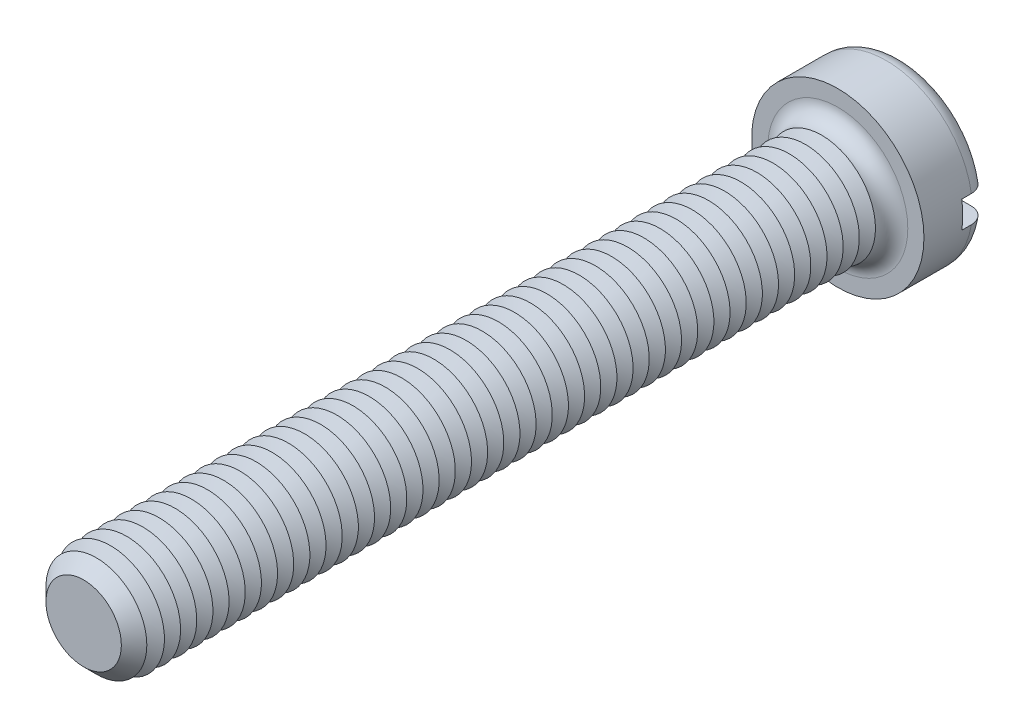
ISO-10303-21;
HEADER;
FILE_DESCRIPTION(('STEP AP214'),'2;1');
FILE_NAME('part.step','',(''),(''),'','','');
FILE_SCHEMA(('AUTOMOTIVE_DESIGN { 1 0 10303 214 1 1 1 1 }'));
ENDSEC;
DATA;
#1=APPLICATION_CONTEXT('core data for automotive mechanical design processes');
#2=APPLICATION_PROTOCOL_DEFINITION('international standard','automotive_design',2000,#1);
#3=PRODUCT_CONTEXT('',#1,'mechanical');
#4=PRODUCT('Part','Part','',(#3));
#5=PRODUCT_RELATED_PRODUCT_CATEGORY('part','',(#4));
#6=PRODUCT_DEFINITION_FORMATION('','',#4);
#7=PRODUCT_DEFINITION_CONTEXT('part definition',#1,'design');
#8=PRODUCT_DEFINITION('design','',#6,#7);
#9=PRODUCT_DEFINITION_SHAPE('','',#8);
#10=(LENGTH_UNIT() NAMED_UNIT(*) SI_UNIT(.MILLI.,.METRE.));
#11=(NAMED_UNIT(*) PLANE_ANGLE_UNIT() SI_UNIT($,.RADIAN.));
#12=(NAMED_UNIT(*) SI_UNIT($,.STERADIAN.) SOLID_ANGLE_UNIT());
#13=UNCERTAINTY_MEASURE_WITH_UNIT(LENGTH_MEASURE(1.E-05),#10,'distance_accuracy_value','');
#14=(GEOMETRIC_REPRESENTATION_CONTEXT(3) GLOBAL_UNCERTAINTY_ASSIGNED_CONTEXT((#13)) GLOBAL_UNIT_ASSIGNED_CONTEXT((#10,
#11,#12)) REPRESENTATION_CONTEXT('',''));
#15=CARTESIAN_POINT('',(0.,0.,0.));
#16=DIRECTION('',(0.,0.,1.));
#17=DIRECTION('',(1.,0.,0.));
#18=AXIS2_PLACEMENT_3D('',#15,#16,#17);
#19=CARTESIAN_POINT('',(0.,0.,-6.));
#20=DIRECTION('',(0.,0.,1.));
#21=DIRECTION('',(1.,0.,0.));
#22=AXIS2_PLACEMENT_3D('',#19,#20,#21);
#23=PLANE('',#22);
#24=CARTESIAN_POINT('',(0.,0.,-6.));
#25=DIRECTION('',(0.,0.,1.));
#26=DIRECTION('',(1.,0.,0.));
#27=AXIS2_PLACEMENT_3D('',#24,#25,#26);
#28=CIRCLE('',#27,6.5);
#29=CARTESIAN_POINT('',(-6.37867541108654,1.25,-6.));
#30=VERTEX_POINT('',#29);
#31=CARTESIAN_POINT('',(6.37867541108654,1.25,-6.));
#32=VERTEX_POINT('',#31);
#33=EDGE_CURVE('E116',#30,#32,#28,.F.);
#34=ORIENTED_EDGE('',*,*,#33,.T.);
#35=DIRECTION('',(1.,0.,0.));
#36=VECTOR('',#35,1.);
#37=CARTESIAN_POINT('',(-8.,1.25,-6.));
#38=LINE('',#37,#36);
#39=EDGE_CURVE('E111',#30,#32,#38,.T.);
#40=ORIENTED_EDGE('',*,*,#39,.F.);
#41=EDGE_LOOP('',(#34,#40));
#42=FACE_BOUND('',#41,.T.);
#43=ADVANCED_FACE('F39',(#42),#23,.F.);
#44=CARTESIAN_POINT('',(0.,0.,-4.5));
#45=DIRECTION('',(0.,0.,1.));
#46=DIRECTION('',(1.,0.,0.));
#47=AXIS2_PLACEMENT_3D('',#44,#45,#46);
#48=TOROIDAL_SURFACE('',#47,6.5,1.5);
#49=CARTESIAN_POINT('',(-7.63778128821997,1.25,-5.34492908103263));
#50=CARTESIAN_POINT('',(-7.58949199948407,1.25,-5.41482553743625));
#51=CARTESIAN_POINT('',(-7.53520056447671,1.25,-5.48065698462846));
#52=CARTESIAN_POINT('',(-7.41624971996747,1.25,-5.60228223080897));
#53=CARTESIAN_POINT('',(-7.35157642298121,1.25,-5.65806236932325));
#54=CARTESIAN_POINT('',(-7.21387612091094,1.25,-5.75795436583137));
#55=CARTESIAN_POINT('',(-7.14085828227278,1.25,-5.80207885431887));
#56=CARTESIAN_POINT('',(-6.98853766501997,1.25,-5.87758013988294));
#57=CARTESIAN_POINT('',(-6.90923642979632,1.25,-5.90896005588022));
#58=CARTESIAN_POINT('',(-6.74565677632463,1.25,-5.95849861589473));
#59=CARTESIAN_POINT('',(-6.66133328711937,1.25,-5.97650838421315));
#60=CARTESIAN_POINT('',(-6.49086565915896,1.25,-5.99833509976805));
#61=CARTESIAN_POINT('',(-6.40472129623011,1.25,-6.00215028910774));
#62=CARTESIAN_POINT('',(-6.23174891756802,1.25,-5.99550457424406));
#63=CARTESIAN_POINT('',(-6.14492874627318,1.25,-5.98483870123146));
#64=CARTESIAN_POINT('',(-5.97427268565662,1.25,-5.94920077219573));
#65=CARTESIAN_POINT('',(-5.89043699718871,1.25,-5.92422775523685));
#66=CARTESIAN_POINT('',(-5.72747580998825,1.25,-5.86041051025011));
#67=CARTESIAN_POINT('',(-5.64839123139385,1.25,-5.8214616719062));
#68=CARTESIAN_POINT('',(-5.49793182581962,1.25,-5.73076137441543));
#69=CARTESIAN_POINT('',(-5.42655700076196,1.25,-5.6790099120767));
#70=CARTESIAN_POINT('',(-5.29410028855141,1.25,-5.56444713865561));
#71=CARTESIAN_POINT('',(-5.23295591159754,1.25,-5.50170815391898));
#72=CARTESIAN_POINT('',(-5.12236155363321,1.25,-5.36664720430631));
#73=CARTESIAN_POINT('',(-5.07291010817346,1.25,-5.29432644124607));
#74=CARTESIAN_POINT('',(-4.98836421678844,1.25,-5.14389152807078));
#75=CARTESIAN_POINT('',(-4.95296843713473,1.25,-5.0659468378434));
#76=CARTESIAN_POINT('',(-4.89620356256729,1.25,-4.90510804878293));
#77=CARTESIAN_POINT('',(-4.87483169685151,1.25,-4.82221493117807));
#78=CARTESIAN_POINT('',(-4.8472995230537,1.25,-4.65636387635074));
#79=CARTESIAN_POINT('',(-4.84072446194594,1.25,-4.57347463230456));
#80=CARTESIAN_POINT('',(-4.84179430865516,1.25,-4.40779255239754));
#81=CARTESIAN_POINT('',(-4.84943782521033,1.25,-4.32499970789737));
#82=CARTESIAN_POINT('',(-4.87846819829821,1.25,-4.16301415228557));
#83=CARTESIAN_POINT('',(-4.89966978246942,1.25,-4.08378809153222));
#84=CARTESIAN_POINT('',(-4.95491528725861,1.25,-3.92995334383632));
#85=CARTESIAN_POINT('',(-4.98895983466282,1.25,-3.85534488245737));
#86=CARTESIAN_POINT('',(-5.06928242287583,1.25,-3.71183790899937));
#87=CARTESIAN_POINT('',(-5.11570495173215,1.25,-3.64302036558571));
#88=CARTESIAN_POINT('',(-5.21915370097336,1.25,-3.51388372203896));
#89=CARTESIAN_POINT('',(-5.27618132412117,1.25,-3.45356574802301));
#90=CARTESIAN_POINT('',(-5.40090076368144,1.25,-3.34137671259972));
#91=CARTESIAN_POINT('',(-5.46884305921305,1.25,-3.28978408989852));
#92=CARTESIAN_POINT('',(-5.61225757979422,1.25,-3.19841811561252));
#93=CARTESIAN_POINT('',(-5.68773079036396,1.25,-3.15864631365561));
#94=CARTESIAN_POINT('',(-5.84602026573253,1.25,-3.09111626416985));
#95=CARTESIAN_POINT('',(-5.92896901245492,1.25,-3.06366820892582));
#96=CARTESIAN_POINT('',(-6.09827849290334,1.25,-3.02294686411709));
#97=CARTESIAN_POINT('',(-6.18463944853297,1.25,-3.00967449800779));
#98=CARTESIAN_POINT('',(-6.35914138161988,1.25,-2.99765063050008));
#99=CARTESIAN_POINT('',(-6.4472913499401,1.25,-2.99902877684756));
#100=CARTESIAN_POINT('',(-6.62209547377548,1.25,-3.01665363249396));
#101=CARTESIAN_POINT('',(-6.70874965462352,1.25,-3.03290008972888));
#102=CARTESIAN_POINT('',(-6.87754008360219,1.25,-3.07975247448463));
#103=CARTESIAN_POINT('',(-6.95969991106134,1.25,-3.11027336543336));
#104=CARTESIAN_POINT('',(-7.11762200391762,1.25,-3.18486653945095));
#105=CARTESIAN_POINT('',(-7.19338469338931,1.25,-3.22893792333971));
#106=CARTESIAN_POINT('',(-7.33522754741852,1.25,-3.32873457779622));
#107=CARTESIAN_POINT('',(-7.40142768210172,1.25,-3.38428930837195));
#108=CARTESIAN_POINT('',(-7.52338344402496,1.25,-3.50587739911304));
#109=CARTESIAN_POINT('',(-7.5791399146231,1.25,-3.57190991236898));
#110=CARTESIAN_POINT('',(-7.67774856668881,1.25,-3.71151097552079));
#111=CARTESIAN_POINT('',(-7.72078137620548,1.25,-3.7849519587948));
#112=CARTESIAN_POINT('',(-7.79373860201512,1.25,-3.93807617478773));
#113=CARTESIAN_POINT('',(-7.82366445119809,1.25,-4.01775872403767));
#114=CARTESIAN_POINT('',(-7.86922494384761,1.25,-4.1801114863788));
#115=CARTESIAN_POINT('',(-7.88502105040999,1.25,-4.26273642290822));
#116=CARTESIAN_POINT('',(-7.90243332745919,1.25,-4.42948977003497));
#117=CARTESIAN_POINT('',(-7.90404643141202,1.25,-4.51361850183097));
#118=CARTESIAN_POINT('',(-7.89306914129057,1.25,-4.68049925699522));
#119=CARTESIAN_POINT('',(-7.88055163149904,1.25,-4.76325613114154));
#120=CARTESIAN_POINT('',(-7.84181179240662,1.25,-4.92542124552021));
#121=CARTESIAN_POINT('',(-7.81560657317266,1.25,-5.00483353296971));
#122=CARTESIAN_POINT('',(-7.76329893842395,1.25,-5.12766777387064));
#123=CARTESIAN_POINT('',(-7.74127773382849,1.25,-5.17287245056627));
#124=CARTESIAN_POINT('',(-7.69279783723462,1.25,-5.26083500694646));
#125=CARTESIAN_POINT('',(-7.66633917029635,1.25,-5.30359290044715));
#126=CARTESIAN_POINT('',(-7.63778128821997,1.25,-5.34492908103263));
#127=B_SPLINE_CURVE_WITH_KNOTS('',3,(#49,#50,#51,#52,#53,#54,#55,#56,#57,#58,#59,#60,#61,#62,
#63,#64,#65,#66,#67,#68,#69,#70,#71,#72,#73,#74,#75,#76,#77,#78,#79,#80,#81,#82,#83,#84,#85,#86,
#87,#88,#89,#90,#91,#92,#93,#94,#95,#96,#97,#98,#99,#100,#101,#102,#103,#104,#105,#106,#107,
#108,#109,#110,#111,#112,#113,#114,#115,#116,#117,#118,#119,#120,#121,#122,#123,#124,#125,#126),
.UNSPECIFIED.,.T.,.F.,(4,2,2,2,2,2,2,2,2,2,2,2,2,2,2,2,2,2,2,2,2,2,2,2,2,2,2,2,2,2,2,2,2,2,2,2,
2,2,4),(0.,0.254678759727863,0.509701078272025,0.764445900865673,1.01912834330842,
1.27660578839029,1.53411511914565,1.7953075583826,2.05651754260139,2.31972495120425,
2.58293242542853,2.84446831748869,3.10597143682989,3.36151874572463,3.61701554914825,
3.86525656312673,4.11347328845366,4.35836855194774,4.60327576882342,4.8511774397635,
5.0991119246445,5.35387584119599,5.60867314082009,5.86956650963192,6.13047687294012,
6.39369803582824,6.65691473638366,6.91858297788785,7.18023385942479,7.43824706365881,
7.69623942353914,7.95037087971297,8.20447454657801,8.45563599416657,8.70685174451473,
8.95677764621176,9.20639187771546,9.35700761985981,9.50762251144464),.UNSPECIFIED.);
#128=CARTESIAN_POINT('',(-7.90174031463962,1.25,-4.50000000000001));
#129=VERTEX_POINT('',#128);
#130=EDGE_CURVE('E545',#129,#30,#127,.T.);
#131=ORIENTED_EDGE('',*,*,#130,.F.);
#132=CARTESIAN_POINT('',(0.,0.,-4.5));
#133=DIRECTION('',(0.,0.,1.));
#134=DIRECTION('',(1.,0.,0.));
#135=AXIS2_PLACEMENT_3D('',#132,#133,#134);
#136=CIRCLE('',#135,8.);
#137=CARTESIAN_POINT('',(7.90174031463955,1.25,-4.5));
#138=VERTEX_POINT('',#137);
#139=EDGE_CURVE('E125',#138,#129,#136,.T.);
#140=ORIENTED_EDGE('',*,*,#139,.F.);
#141=CARTESIAN_POINT('',(4.95236709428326,1.25,-5.05808354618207));
#142=CARTESIAN_POINT('',(4.98477386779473,1.25,-5.13646278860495));
#143=CARTESIAN_POINT('',(5.02397623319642,1.25,-5.21210974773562));
#144=CARTESIAN_POINT('',(5.11464829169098,1.25,-5.35575180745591));
#145=CARTESIAN_POINT('',(5.16613670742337,1.25,-5.42373499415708));
#146=CARTESIAN_POINT('',(5.27963080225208,1.25,-5.55005899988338));
#147=CARTESIAN_POINT('',(5.34161871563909,1.25,-5.60841578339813));
#148=CARTESIAN_POINT('',(5.47431803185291,1.25,-5.71412381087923));
#149=CARTESIAN_POINT('',(5.545027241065,1.25,-5.76147781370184));
#150=CARTESIAN_POINT('',(5.69469818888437,1.25,-5.84486022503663));
#151=CARTESIAN_POINT('',(5.77379661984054,1.25,-5.88064336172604));
#152=CARTESIAN_POINT('',(5.93682776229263,1.25,-5.93863952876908));
#153=CARTESIAN_POINT('',(6.02076112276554,1.25,-5.96085073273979));
#154=CARTESIAN_POINT('',(6.19235911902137,1.25,-5.99130732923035));
#155=CARTESIAN_POINT('',(6.2800597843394,1.25,-5.99935025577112));
#156=CARTESIAN_POINT('',(6.45556807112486,1.25,-6.00057400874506));
#157=CARTESIAN_POINT('',(6.54337569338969,1.25,-5.99375472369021));
#158=CARTESIAN_POINT('',(6.71642471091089,1.25,-5.96539034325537));
#159=CARTESIAN_POINT('',(6.8016703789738,1.25,-5.94387137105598));
#160=CARTESIAN_POINT('',(6.96726399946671,1.25,-5.8866508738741));
#161=CARTESIAN_POINT('',(7.04761223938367,1.25,-5.85095018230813));
#162=CARTESIAN_POINT('',(7.2000703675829,1.25,-5.7668235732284));
#163=CARTESIAN_POINT('',(7.27226868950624,1.25,-5.71855796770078));
#164=CARTESIAN_POINT('',(7.40737382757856,1.25,-5.61041520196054));
#165=CARTESIAN_POINT('',(7.47028138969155,1.25,-5.55053897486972));
#166=CARTESIAN_POINT('',(7.5840004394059,1.25,-5.42185995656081));
#167=CARTESIAN_POINT('',(7.63498189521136,1.25,-5.35320736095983));
#168=CARTESIAN_POINT('',(7.72451646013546,1.25,-5.20822613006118));
#169=CARTESIAN_POINT('',(7.76307051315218,1.25,-5.13189807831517));
#170=CARTESIAN_POINT('',(7.82615156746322,1.25,-4.97479919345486));
#171=CARTESIAN_POINT('',(7.85085353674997,1.25,-4.89409858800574));
#172=CARTESIAN_POINT('',(7.88624162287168,1.25,-4.72968126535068));
#173=CARTESIAN_POINT('',(7.89692844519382,1.25,-4.64596470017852));
#174=CARTESIAN_POINT('',(7.90393395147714,1.25,-4.47857496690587));
#175=CARTESIAN_POINT('',(7.900361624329,1.25,-4.39490633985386));
#176=CARTESIAN_POINT('',(7.8792027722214,1.25,-4.22936201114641));
#177=CARTESIAN_POINT('',(7.86161649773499,1.25,-4.14748627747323));
#178=CARTESIAN_POINT('',(7.81298565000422,1.25,-3.98793539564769));
#179=CARTESIAN_POINT('',(7.78195585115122,1.25,-3.91025574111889));
#180=CARTESIAN_POINT('',(7.70736418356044,1.25,-3.76116938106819));
#181=CARTESIAN_POINT('',(7.66380211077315,1.25,-3.68976277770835));
#182=CARTESIAN_POINT('',(7.56515173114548,1.25,-3.55480889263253));
#183=CARTESIAN_POINT('',(7.51000119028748,1.25,-3.49130712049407));
#184=CARTESIAN_POINT('',(7.38992820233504,1.25,-3.3743390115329));
#185=CARTESIAN_POINT('',(7.32500529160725,1.25,-3.32087315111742));
#186=CARTESIAN_POINT('',(7.18646521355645,1.25,-3.22483712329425));
#187=CARTESIAN_POINT('',(7.11275872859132,1.25,-3.18239583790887));
#188=CARTESIAN_POINT('',(6.95934489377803,1.25,-3.11028530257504));
#189=CARTESIAN_POINT('',(6.87963710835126,1.25,-3.08061698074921));
#190=CARTESIAN_POINT('',(6.71523243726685,1.25,-3.03442872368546));
#191=CARTESIAN_POINT('',(6.63047940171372,1.25,-3.0181086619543));
#192=CARTESIAN_POINT('',(6.45944163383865,1.25,-2.99971307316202));
#193=CARTESIAN_POINT('',(6.37315677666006,1.25,-2.99763871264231));
#194=CARTESIAN_POINT('',(6.20021063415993,1.25,-3.00779604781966));
#195=CARTESIAN_POINT('',(6.11356117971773,1.25,-3.02022976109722));
#196=CARTESIAN_POINT('',(5.94354092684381,1.25,-3.05935975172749));
#197=CARTESIAN_POINT('',(5.86017035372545,1.25,-3.08605700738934));
#198=CARTESIAN_POINT('',(5.69848536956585,1.25,-3.15322746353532));
#199=CARTESIAN_POINT('',(5.62021039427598,1.25,-3.1937956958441));
#200=CARTESIAN_POINT('',(5.47164170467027,1.25,-3.28758816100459));
#201=CARTESIAN_POINT('',(5.40134797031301,1.25,-3.3408123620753));
#202=CARTESIAN_POINT('',(5.27136483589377,1.25,-3.45806317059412));
#203=CARTESIAN_POINT('',(5.21160120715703,1.25,-3.52200740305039));
#204=CARTESIAN_POINT('',(5.10396941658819,1.25,-3.65922833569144));
#205=CARTESIAN_POINT('',(5.05609917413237,1.25,-3.73250340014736));
#206=CARTESIAN_POINT('',(4.97487058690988,1.25,-3.8844714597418));
#207=CARTESIAN_POINT('',(4.94119529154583,1.25,-3.96299495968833));
#208=CARTESIAN_POINT('',(4.88793322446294,1.25,-4.12470694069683));
#209=CARTESIAN_POINT('',(4.86834741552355,1.25,-4.20789574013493));
#210=CARTESIAN_POINT('',(4.84433446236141,1.25,-4.3740749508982));
#211=CARTESIAN_POINT('',(4.83950391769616,1.25,-4.45700748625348));
#212=CARTESIAN_POINT('',(4.84404021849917,1.25,-4.62240731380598));
#213=CARTESIAN_POINT('',(4.85338770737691,1.25,-4.70487508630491));
#214=CARTESIAN_POINT('',(4.87895619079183,1.25,-4.83246978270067));
#215=CARTESIAN_POINT('',(4.89056704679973,1.25,-4.87856970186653));
#216=CARTESIAN_POINT('',(4.91819711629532,1.25,-4.96942661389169));
#217=CARTESIAN_POINT('',(4.93421619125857,1.25,-5.01418364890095));
#218=CARTESIAN_POINT('',(4.95236709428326,1.25,-5.05808354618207));
#219=B_SPLINE_CURVE_WITH_KNOTS('',3,(#141,#142,#143,#144,#145,#146,#147,#148,#149,#150,#151,
#152,#153,#154,#155,#156,#157,#158,#159,#160,#161,#162,#163,#164,#165,#166,#167,#168,#169,#170,
#171,#172,#173,#174,#175,#176,#177,#178,#179,#180,#181,#182,#183,#184,#185,#186,#187,#188,#189,
#190,#191,#192,#193,#194,#195,#196,#197,#198,#199,#200,#201,#202,#203,#204,#205,#206,#207,#208,
#209,#210,#211,#212,#213,#214,#215,#216,#217,#218),.UNSPECIFIED.,.T.,.F.,(4,2,2,2,2,2,2,2,2,2,2,
2,2,2,2,2,2,2,2,2,2,2,2,2,2,2,2,2,2,2,2,2,2,2,2,2,2,2,4),(0.,0.25426396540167,0.508917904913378,
0.763145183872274,1.01730864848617,1.27655188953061,1.53583000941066,1.79878406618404,
2.06174009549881,2.32423003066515,2.5867045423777,2.84598168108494,3.10523799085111,
3.36053725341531,3.61581712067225,3.8677953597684,4.11976091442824,4.36980428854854,
4.61984319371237,4.86960800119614,5.11937687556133,5.37052303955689,5.62168112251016,
5.87565515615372,6.12964764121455,6.38737709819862,6.64512765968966,6.90651052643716,
7.16791132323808,7.43114013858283,7.69436829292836,7.95565940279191,8.21690477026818,
8.47196060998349,8.72703387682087,8.97506819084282,9.22276418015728,9.36518087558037,
9.50759309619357),.UNSPECIFIED.);
#220=EDGE_CURVE('E547',#32,#138,#219,.T.);
#221=ORIENTED_EDGE('',*,*,#220,.F.);
#222=ORIENTED_EDGE('',*,*,#33,.F.);
#223=EDGE_LOOP('',(#131,#140,#221,#222));
#224=FACE_BOUND('',#223,.T.);
#225=ADVANCED_FACE('F529',(#224),#48,.T.);
#226=CARTESIAN_POINT('',(0.,0.,-6.));
#227=DIRECTION('',(0.,0.,1.));
#228=DIRECTION('',(1.,0.,0.));
#229=AXIS2_PLACEMENT_3D('',#226,#227,#228);
#230=CYLINDRICAL_SURFACE('',#229,8.);
#231=DIRECTION('',(0.,0.,1.));
#232=VECTOR('',#231,1.);
#233=CARTESIAN_POINT('',(7.90174031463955,1.25,-6.));
#234=LINE('',#233,#232);
#235=CARTESIAN_POINT('',(7.90174031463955,1.25,-3.6));
#236=VERTEX_POINT('',#235);
#237=EDGE_CURVE('E562',#138,#236,#234,.T.);
#238=ORIENTED_EDGE('',*,*,#237,.F.);
#239=ORIENTED_EDGE('',*,*,#139,.T.);
#240=DIRECTION('',(0.,0.,1.));
#241=VECTOR('',#240,1.);
#242=CARTESIAN_POINT('',(-7.90174031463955,1.25,-6.));
#243=LINE('',#242,#241);
#244=CARTESIAN_POINT('',(-7.90174031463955,1.25,-3.6));
#245=VERTEX_POINT('',#244);
#246=EDGE_CURVE('E63',#245,#129,#243,.F.);
#247=ORIENTED_EDGE('',*,*,#246,.F.);
#248=CARTESIAN_POINT('',(0.,0.,-3.6));
#249=DIRECTION('',(0.,0.,-1.));
#250=DIRECTION('',(-1.,0.,0.));
#251=AXIS2_PLACEMENT_3D('',#248,#249,#250);
#252=CIRCLE('',#251,8.);
#253=CARTESIAN_POINT('',(-7.90174031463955,-1.25,-3.6));
#254=VERTEX_POINT('',#253);
#255=EDGE_CURVE('E43',#245,#254,#252,.F.);
#256=ORIENTED_EDGE('',*,*,#255,.T.);
#257=DIRECTION('',(0.,0.,1.));
#258=VECTOR('',#257,1.);
#259=CARTESIAN_POINT('',(-7.90174031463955,-1.25,-6.));
#260=LINE('',#259,#258);
#261=CARTESIAN_POINT('',(-7.9017403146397,-1.25,-4.49999999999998));
#262=VERTEX_POINT('',#261);
#263=EDGE_CURVE('E560',#262,#254,#260,.T.);
#264=ORIENTED_EDGE('',*,*,#263,.F.);
#265=CARTESIAN_POINT('',(7.90174031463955,-1.25,-4.5));
#266=VERTEX_POINT('',#265);
#267=EDGE_CURVE('E127',#262,#266,#136,.T.);
#268=ORIENTED_EDGE('',*,*,#267,.T.);
#269=DIRECTION('',(0.,0.,1.));
#270=VECTOR('',#269,1.);
#271=CARTESIAN_POINT('',(7.90174031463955,-1.25,-6.));
#272=LINE('',#271,#270);
#273=CARTESIAN_POINT('',(7.90174031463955,-1.25,-3.6));
#274=VERTEX_POINT('',#273);
#275=EDGE_CURVE('E55',#274,#266,#272,.F.);
#276=ORIENTED_EDGE('',*,*,#275,.F.);
#277=EDGE_CURVE('E11',#274,#236,#252,.F.);
#278=ORIENTED_EDGE('',*,*,#277,.T.);
#279=EDGE_LOOP('',(#238,#239,#247,#256,#264,#268,#276,#278));
#280=FACE_BOUND('',#279,.T.);
#281=CARTESIAN_POINT('',(0.,0.,0.));
#282=DIRECTION('',(0.,0.,1.));
#283=DIRECTION('',(1.,0.,0.));
#284=AXIS2_PLACEMENT_3D('',#281,#282,#283);
#285=CIRCLE('',#284,8.);
#286=CARTESIAN_POINT('',(8.,0.,0.));
#287=VERTEX_POINT('',#286);
#288=EDGE_CURVE('E565',#287,#287,#285,.T.);
#289=ORIENTED_EDGE('',*,*,#288,.F.);
#290=EDGE_LOOP('',(#289));
#291=FACE_BOUND('',#290,.T.);
#292=ADVANCED_FACE('F525',(#280,#291),#230,.T.);
#293=CARTESIAN_POINT('',(6.37867541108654,-1.25,-6.));
#294=VERTEX_POINT('',#293);
#295=CARTESIAN_POINT('',(-6.37867541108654,-1.25,-6.));
#296=VERTEX_POINT('',#295);
#297=EDGE_CURVE('E109',#294,#296,#28,.F.);
#298=ORIENTED_EDGE('',*,*,#297,.T.);
#299=DIRECTION('',(-1.,0.,0.));
#300=VECTOR('',#299,1.);
#301=CARTESIAN_POINT('',(-8.,-1.25,-6.));
#302=LINE('',#301,#300);
#303=EDGE_CURVE('E96',#294,#296,#302,.T.);
#304=ORIENTED_EDGE('',*,*,#303,.F.);
#305=EDGE_LOOP('',(#298,#304));
#306=FACE_BOUND('',#305,.T.);
#307=ADVANCED_FACE('F108',(#306),#23,.F.);
#308=CARTESIAN_POINT('',(0.,0.,0.));
#309=DIRECTION('',(0.,0.,1.));
#310=DIRECTION('',(1.,0.,0.));
#311=AXIS2_PLACEMENT_3D('',#308,#309,#310);
#312=PLANE('',#311);
#313=CARTESIAN_POINT('',(0.,0.,0.));
#314=DIRECTION('',(0.,0.,1.));
#315=DIRECTION('',(1.,0.,0.));
#316=AXIS2_PLACEMENT_3D('',#313,#314,#315);
#317=CIRCLE('',#316,6.5);
#318=CARTESIAN_POINT('',(6.5,0.,0.));
#319=VERTEX_POINT('',#318);
#320=EDGE_CURVE('E115',#319,#319,#317,.F.);
#321=ORIENTED_EDGE('',*,*,#320,.T.);
#322=EDGE_LOOP('',(#321));
#323=FACE_BOUND('',#322,.T.);
#324=ORIENTED_EDGE('',*,*,#288,.T.);
#325=EDGE_LOOP('',(#324));
#326=FACE_BOUND('',#325,.T.);
#327=ADVANCED_FACE('F524',(#323,#326),#312,.T.);
#328=CARTESIAN_POINT('',(-7.63778128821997,-1.25,-5.34492908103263));
#329=CARTESIAN_POINT('',(-7.68527581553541,-1.25,-5.27616964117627));
#330=CARTESIAN_POINT('',(-7.72703224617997,-1.25,-5.20337764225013));
#331=CARTESIAN_POINT('',(-7.79778035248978,-1.25,-5.05176511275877));
#332=CARTESIAN_POINT('',(-7.82675823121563,-1.25,-4.97293817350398));
#333=CARTESIAN_POINT('',(-7.87103239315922,-1.25,-4.81153865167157));
#334=CARTESIAN_POINT('',(-7.8863313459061,-1.25,-4.72896680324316));
#335=CARTESIAN_POINT('',(-7.90278562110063,-1.25,-4.56244566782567));
#336=CARTESIAN_POINT('',(-7.90394420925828,-1.25,-4.4784967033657));
#337=CARTESIAN_POINT('',(-7.89211470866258,-1.25,-4.31190980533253));
#338=CARTESIAN_POINT('',(-7.87917806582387,-1.25,-4.22926821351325));
#339=CARTESIAN_POINT('',(-7.8396278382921,-1.25,-4.06732477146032));
#340=CARTESIAN_POINT('',(-7.81301388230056,-1.25,-3.98802301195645));
#341=CARTESIAN_POINT('',(-7.74686575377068,-1.25,-3.83490116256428));
#342=CARTESIAN_POINT('',(-7.70731700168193,-1.25,-3.76108737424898));
#343=CARTESIAN_POINT('',(-7.61647675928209,-1.25,-3.62108231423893));
#344=CARTESIAN_POINT('',(-7.56518496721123,-1.25,-3.55489123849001));
#345=CARTESIAN_POINT('',(-7.45192141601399,-1.25,-3.43145488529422));
#346=CARTESIAN_POINT('',(-7.3898717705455,-1.25,-3.37428109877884));
#347=CARTESIAN_POINT('',(-7.25715883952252,-1.25,-3.27100737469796));
#348=CARTESIAN_POINT('',(-7.18649507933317,-1.25,-3.22490804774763));
#349=CARTESIAN_POINT('',(-7.03760898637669,-1.25,-3.14445316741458));
#350=CARTESIAN_POINT('',(-6.95930204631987,-1.25,-3.1102542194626));
#351=CARTESIAN_POINT('',(-6.79811453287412,-1.25,-3.05526915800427));
#352=CARTESIAN_POINT('',(-6.71523359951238,-1.25,-3.03448410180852));
#353=CARTESIAN_POINT('',(-6.5459165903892,-1.25,-3.006592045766));
#354=CARTESIAN_POINT('',(-6.45944575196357,-1.25,-2.99969602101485));
#355=CARTESIAN_POINT('',(-6.28655568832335,-1.25,-3.00032465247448));
#356=CARTESIAN_POINT('',(-6.20013646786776,-1.25,-3.00785047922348));
#357=CARTESIAN_POINT('',(-6.02865505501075,-1.25,-3.03725742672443));
#358=CARTESIAN_POINT('',(-5.94362352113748,-1.25,-3.05931758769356));
#359=CARTESIAN_POINT('',(-5.77844448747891,-1.25,-3.11735373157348));
#360=CARTESIAN_POINT('',(-5.69829723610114,-1.25,-3.15333042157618));
#361=CARTESIAN_POINT('',(-5.54495924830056,-1.25,-3.23837037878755));
#362=CARTESIAN_POINT('',(-5.47178958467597,-1.25,-3.28747168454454));
#363=CARTESIAN_POINT('',(-5.33486536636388,-1.25,-3.39741183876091));
#364=CARTESIAN_POINT('',(-5.27111040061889,-1.25,-3.45825017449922));
#365=CARTESIAN_POINT('',(-5.15579778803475,-1.25,-3.58914722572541));
#366=CARTESIAN_POINT('',(-5.10409113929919,-1.25,-3.65907455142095));
#367=CARTESIAN_POINT('',(-5.01353659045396,-1.25,-3.8068142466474));
#368=CARTESIAN_POINT('',(-4.97468647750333,-1.25,-3.88462525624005));
#369=CARTESIAN_POINT('',(-4.91208858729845,-1.25,-4.04366636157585));
#370=CARTESIAN_POINT('',(-4.88795969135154,-1.25,-4.12474643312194));
#371=CARTESIAN_POINT('',(-4.85404909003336,-1.25,-4.28985038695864));
#372=CARTESIAN_POINT('',(-4.84426486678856,-1.25,-4.37387374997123));
#373=CARTESIAN_POINT('',(-4.83946276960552,-1.25,-4.54023897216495));
#374=CARTESIAN_POINT('',(-4.8440833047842,-1.25,-4.62257060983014));
#375=CARTESIAN_POINT('',(-4.86713763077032,-1.25,-4.78527148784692));
#376=CARTESIAN_POINT('',(-4.88557092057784,-1.25,-4.86564079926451));
#377=CARTESIAN_POINT('',(-4.9355229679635,-1.25,-5.02189555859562));
#378=CARTESIAN_POINT('',(-4.9669975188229,-1.25,-5.09779517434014));
#379=CARTESIAN_POINT('',(-5.04199393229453,-1.25,-5.24338322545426));
#380=CARTESIAN_POINT('',(-5.0855168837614,-1.25,-5.31307109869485));
#381=CARTESIAN_POINT('',(-5.18427540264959,-1.25,-5.44580979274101));
#382=CARTESIAN_POINT('',(-5.2397318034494,-1.25,-5.50869620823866));
#383=CARTESIAN_POINT('',(-5.36015301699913,-1.25,-5.62458635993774));
#384=CARTESIAN_POINT('',(-5.42511919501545,-1.25,-5.67758867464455));
#385=CARTESIAN_POINT('',(-5.56469412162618,-1.25,-5.7737610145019));
#386=CARTESIAN_POINT('',(-5.6395232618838,-1.25,-5.81661133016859));
#387=CARTESIAN_POINT('',(-5.79521544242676,-1.25,-5.8894110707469));
#388=CARTESIAN_POINT('',(-5.8760791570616,-1.25,-5.91935905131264));
#389=CARTESIAN_POINT('',(-6.04317815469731,-1.25,-5.9660059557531));
#390=CARTESIAN_POINT('',(-6.12948555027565,-1.25,-5.98244700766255));
#391=CARTESIAN_POINT('',(-6.30363462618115,-1.25,-6.00064866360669));
#392=CARTESIAN_POINT('',(-6.39147629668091,-1.25,-6.00240936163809));
#393=CARTESIAN_POINT('',(-6.5664192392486,-1.25,-5.9911248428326));
#394=CARTESIAN_POINT('',(-6.653518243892,-1.25,-5.9780442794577));
#395=CARTESIAN_POINT('',(-6.82426167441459,-1.25,-5.93729204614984));
#396=CARTESIAN_POINT('',(-6.90790538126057,-1.25,-5.90961735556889));
#397=CARTESIAN_POINT('',(-7.06846412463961,-1.25,-5.84071272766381));
#398=CARTESIAN_POINT('',(-7.14543542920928,-1.25,-5.79961377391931));
#399=CARTESIAN_POINT('',(-7.29116896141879,-1.25,-5.70491210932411));
#400=CARTESIAN_POINT('',(-7.35994165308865,-1.25,-5.65132560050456));
#401=CARTESIAN_POINT('',(-7.46362894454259,-1.25,-5.55509815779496));
#402=CARTESIAN_POINT('',(-7.50165191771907,-1.25,-5.51575032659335));
#403=CARTESIAN_POINT('',(-7.57319530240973,-1.25,-5.43315308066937));
#404=CARTESIAN_POINT('',(-7.60671575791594,-1.25,-5.38990370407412));
#405=CARTESIAN_POINT('',(-7.63778128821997,-1.25,-5.34492908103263));
#406=B_SPLINE_CURVE_WITH_KNOTS('',3,(#328,#329,#330,#331,#332,#333,#334,#335,#336,#337,#338,
#339,#340,#341,#342,#343,#344,#345,#346,#347,#348,#349,#350,#351,#352,#353,#354,#355,#356,#357,
#358,#359,#360,#361,#362,#363,#364,#365,#366,#367,#368,#369,#370,#371,#372,#373,#374,#375,#376,
#377,#378,#379,#380,#381,#382,#383,#384,#385,#386,#387,#388,#389,#390,#391,#392,#393,#394,#395,
#396,#397,#398,#399,#400,#401,#402,#403,#404,#405),.UNSPECIFIED.,.T.,.F.,(4,2,2,2,2,2,2,2,2,2,2,
2,2,2,2,2,2,2,2,2,2,2,2,2,2,2,2,2,2,2,2,2,2,2,2,2,2,2,4),(0.,0.250506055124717,
0.501281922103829,0.752008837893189,1.00267784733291,1.25243500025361,1.50219893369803,
1.75224536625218,2.00229822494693,2.25424343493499,2.50620253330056,2.76136198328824,
3.01654154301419,3.27556891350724,3.53461730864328,3.79691797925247,4.05923197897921,
4.32231463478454,4.5853858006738,4.84500678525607,5.10458306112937,5.3571172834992,
5.60960717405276,5.85581050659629,6.10200490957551,6.34737151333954,6.59276029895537,
6.84315522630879,7.09358613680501,7.35108485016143,7.60861238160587,7.87094926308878,
8.13328446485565,8.39624576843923,8.65926152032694,8.91978401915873,9.17997036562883,
9.34382460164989,9.50767723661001),.UNSPECIFIED.);
#407=EDGE_CURVE('E103',#296,#262,#406,.T.);
#408=ORIENTED_EDGE('',*,*,#407,.F.);
#409=ORIENTED_EDGE('',*,*,#297,.F.);
#410=CARTESIAN_POINT('',(4.95236709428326,-1.25,-5.05808354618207));
#411=CARTESIAN_POINT('',(4.92105512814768,-1.25,-4.98233216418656));
#412=CARTESIAN_POINT('',(4.89604361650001,-1.25,-4.90392040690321));
#413=CARTESIAN_POINT('',(4.85951223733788,-1.25,-4.74395758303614));
#414=CARTESIAN_POINT('',(4.8480045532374,-1.25,-4.66240375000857));
#415=CARTESIAN_POINT('',(4.83891469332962,-1.25,-4.49852199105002));
#416=CARTESIAN_POINT('',(4.84133145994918,-1.25,-4.41619412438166));
#417=CARTESIAN_POINT('',(4.8600038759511,-1.25,-4.25314313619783));
#418=CARTESIAN_POINT('',(4.87625705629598,-1.25,-4.17241973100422));
#419=CARTESIAN_POINT('',(4.92196554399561,-1.25,-4.01505032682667));
#420=CARTESIAN_POINT('',(4.95138456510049,-1.25,-3.93839376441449));
#421=CARTESIAN_POINT('',(5.02244158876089,-1.25,-3.79097367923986));
#422=CARTESIAN_POINT('',(5.06408092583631,-1.25,-3.72021080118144));
#423=CARTESIAN_POINT('',(5.15918188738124,-1.25,-3.5851203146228));
#424=CARTESIAN_POINT('',(5.21285223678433,-1.25,-3.5209397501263));
#425=CARTESIAN_POINT('',(5.32993512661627,-1.25,-3.40218700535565));
#426=CARTESIAN_POINT('',(5.39334903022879,-1.25,-3.34761617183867));
#427=CARTESIAN_POINT('',(5.5300552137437,-1.25,-3.24801679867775));
#428=CARTESIAN_POINT('',(5.60357647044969,-1.25,-3.20330242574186));
#429=CARTESIAN_POINT('',(5.75697062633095,-1.25,-3.1265687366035));
#430=CARTESIAN_POINT('',(5.83684424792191,-1.25,-3.09455086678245));
#431=CARTESIAN_POINT('',(6.00239031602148,-1.25,-3.04353393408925));
#432=CARTESIAN_POINT('',(6.08814636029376,-1.25,-3.02480570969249));
#433=CARTESIAN_POINT('',(6.26158564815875,-1.25,-3.00194915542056));
#434=CARTESIAN_POINT('',(6.34926896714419,-1.25,-2.997821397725));
#435=CARTESIAN_POINT('',(6.52441816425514,-1.25,-3.00435236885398));
#436=CARTESIAN_POINT('',(6.61188199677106,-1.25,-3.01506655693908));
#437=CARTESIAN_POINT('',(6.78373130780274,-1.25,-3.05116556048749));
#438=CARTESIAN_POINT('',(6.8681168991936,-1.25,-3.07654983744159));
#439=CARTESIAN_POINT('',(7.03056473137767,-1.25,-3.14105639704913));
#440=CARTESIAN_POINT('',(7.10867812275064,-1.25,-3.18004978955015));
#441=CARTESIAN_POINT('',(7.25711285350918,-1.25,-3.27078804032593));
#442=CARTESIAN_POINT('',(7.327434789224,-1.25,-3.32253192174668));
#443=CARTESIAN_POINT('',(7.45716954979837,-1.25,-3.4364775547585));
#444=CARTESIAN_POINT('',(7.51672925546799,-1.25,-3.49851206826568));
#445=CARTESIAN_POINT('',(7.62440498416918,-1.25,-3.63182557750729));
#446=CARTESIAN_POINT('',(7.67252193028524,-1.25,-3.70310382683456));
#447=CARTESIAN_POINT('',(7.75523498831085,-1.25,-3.8517825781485));
#448=CARTESIAN_POINT('',(7.79001407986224,-1.25,-3.92908131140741));
#449=CARTESIAN_POINT('',(7.84595474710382,-1.25,-4.08845836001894));
#450=CARTESIAN_POINT('',(7.86711715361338,-1.25,-4.1705363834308));
#451=CARTESIAN_POINT('',(7.89503817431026,-1.25,-4.3362768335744));
#452=CARTESIAN_POINT('',(7.90193595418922,-1.25,-4.41991584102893));
#453=CARTESIAN_POINT('',(7.90153623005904,-1.25,-4.58715860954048));
#454=CARTESIAN_POINT('',(7.89423915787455,-1.25,-4.67076237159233));
#455=CARTESIAN_POINT('',(7.86572271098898,-1.25,-4.83525080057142));
#456=CARTESIAN_POINT('',(7.84455307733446,-1.25,-4.91614410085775));
#457=CARTESIAN_POINT('',(7.78897430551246,-1.25,-5.0732444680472));
#458=CARTESIAN_POINT('',(7.75456511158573,-1.25,-5.1494515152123));
#459=CARTESIAN_POINT('',(7.67339923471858,-1.25,-5.29528903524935));
#460=CARTESIAN_POINT('',(7.62660424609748,-1.25,-5.36489817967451));
#461=CARTESIAN_POINT('',(7.52209201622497,-1.25,-5.49536318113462));
#462=CARTESIAN_POINT('',(7.4643743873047,-1.25,-5.55621872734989));
#463=CARTESIAN_POINT('',(7.33909994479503,-1.25,-5.66807257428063));
#464=CARTESIAN_POINT('',(7.27145672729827,-1.25,-5.71897407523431));
#465=CARTESIAN_POINT('',(7.12868060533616,-1.25,-5.80887807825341));
#466=CARTESIAN_POINT('',(7.0535472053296,-1.25,-5.84787979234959));
#467=CARTESIAN_POINT('',(6.89682225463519,-1.25,-5.91345911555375));
#468=CARTESIAN_POINT('',(6.81515596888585,-1.25,-5.93985808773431));
#469=CARTESIAN_POINT('',(6.64858434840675,-1.25,-5.97879449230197));
#470=CARTESIAN_POINT('',(6.56367874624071,-1.25,-5.99133077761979));
#471=CARTESIAN_POINT('',(6.39168259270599,-1.25,-6.00236627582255));
#472=CARTESIAN_POINT('',(6.30457835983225,-1.25,-6.00065255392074));
#473=CARTESIAN_POINT('',(6.13186422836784,-1.25,-5.98278857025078));
#474=CARTESIAN_POINT('',(6.04625438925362,-1.25,-5.96663773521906));
#475=CARTESIAN_POINT('',(5.87802521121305,-1.25,-5.92012173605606));
#476=CARTESIAN_POINT('',(5.79544617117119,-1.25,-5.88961066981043));
#477=CARTESIAN_POINT('',(5.63656223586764,-1.25,-5.81513349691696));
#478=CARTESIAN_POINT('',(5.56025908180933,-1.25,-5.77116367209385));
#479=CARTESIAN_POINT('',(5.4162607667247,-1.25,-5.67098882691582));
#480=CARTESIAN_POINT('',(5.34855795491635,-1.25,-5.61479480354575));
#481=CARTESIAN_POINT('',(5.22382615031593,-1.25,-5.49168804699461));
#482=CARTESIAN_POINT('',(5.16678340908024,-1.25,-5.42478932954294));
#483=CARTESIAN_POINT('',(5.08326589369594,-1.25,-5.3075481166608));
#484=CARTESIAN_POINT('',(5.05313168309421,-1.25,-5.25976959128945));
#485=CARTESIAN_POINT('',(4.99845900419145,-1.25,-5.16110869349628));
#486=CARTESIAN_POINT('',(4.9739204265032,-1.25,-5.11022638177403));
#487=CARTESIAN_POINT('',(4.95236709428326,-1.25,-5.05808354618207));
#488=B_SPLINE_CURVE_WITH_KNOTS('',3,(#410,#411,#412,#413,#414,#415,#416,#417,#418,#419,#420,
#421,#422,#423,#424,#425,#426,#427,#428,#429,#430,#431,#432,#433,#434,#435,#436,#437,#438,#439,
#440,#441,#442,#443,#444,#445,#446,#447,#448,#449,#450,#451,#452,#453,#454,#455,#456,#457,#458,
#459,#460,#461,#462,#463,#464,#465,#466,#467,#468,#469,#470,#471,#472,#473,#474,#475,#476,#477,
#478,#479,#480,#481,#482,#483,#484,#485,#486,#487),.UNSPECIFIED.,.T.,.F.,(4,2,2,2,2,2,2,2,2,2,2,
2,2,2,2,2,2,2,2,2,2,2,2,2,2,2,2,2,2,2,2,2,2,2,2,2,2,2,4),(0.,0.245701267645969,
0.491624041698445,0.737528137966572,0.983388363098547,1.22857510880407,1.47378864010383,
1.72364048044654,1.97352730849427,2.2304941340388,2.48749022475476,2.74958408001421,
3.01168820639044,3.2747743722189,3.53785088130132,3.79850056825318,4.05913029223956,
4.31587819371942,4.57260537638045,4.82567253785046,5.07872425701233,5.32929532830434,
5.57985877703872,5.82952869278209,6.07919966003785,6.32965199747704,6.58011322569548,
6.8329006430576,7.08570479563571,7.3419930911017,7.59830259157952,7.85844887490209,
8.11860548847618,8.38146435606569,8.64439590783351,8.90709189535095,9.16944670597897,
9.33857644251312,9.5077028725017),.UNSPECIFIED.);
#489=EDGE_CURVE('E92',#266,#294,#488,.T.);
#490=ORIENTED_EDGE('',*,*,#489,.F.);
#491=ORIENTED_EDGE('',*,*,#267,.F.);
#492=EDGE_LOOP('',(#408,#409,#490,#491));
#493=FACE_BOUND('',#492,.T.);
#494=ADVANCED_FACE('F113',(#493),#48,.T.);
#495=CARTESIAN_POINT('',(0.,0.,1.5));
#496=DIRECTION('',(0.,0.,1.));
#497=DIRECTION('',(1.,0.,0.));
#498=AXIS2_PLACEMENT_3D('',#495,#496,#497);
#499=TOROIDAL_SURFACE('',#498,6.5,1.5);
#500=ORIENTED_EDGE('',*,*,#320,.F.);
#501=EDGE_LOOP('',(#500));
#502=FACE_BOUND('',#501,.T.);
#503=CARTESIAN_POINT('',(0.,0.,1.5));
#504=DIRECTION('',(0.,0.,-1.));
#505=DIRECTION('',(-1.,0.,0.));
#506=AXIS2_PLACEMENT_3D('',#503,#504,#505);
#507=CIRCLE('',#506,5.);
#508=CARTESIAN_POINT('',(-5.,0.,1.5));
#509=VERTEX_POINT('',#508);
#510=EDGE_CURVE('E570',#509,#509,#507,.T.);
#511=ORIENTED_EDGE('',*,*,#510,.T.);
#512=EDGE_LOOP('',(#511));
#513=FACE_BOUND('',#512,.T.);
#514=ADVANCED_FACE('F517',(#502,#513),#499,.F.);
#515=CARTESIAN_POINT('',(0.,0.,2.25));
#516=DIRECTION('',(0.,0.,-1.));
#517=DIRECTION('',(-1.,0.,0.));
#518=AXIS2_PLACEMENT_3D('',#515,#516,#517);
#519=CONICAL_SURFACE('',#518,3.70096189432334,1.0471975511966);
#520=ORIENTED_EDGE('',*,*,#510,.F.);
#521=EDGE_LOOP('',(#520));
#522=FACE_BOUND('',#521,.T.);
#523=CARTESIAN_POINT('',(0.,0.,2.25));
#524=DIRECTION('',(0.,0.,-1.));
#525=DIRECTION('',(-1.,0.,0.));
#526=AXIS2_PLACEMENT_3D('',#523,#524,#525);
#527=CIRCLE('',#526,3.70096189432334);
#528=CARTESIAN_POINT('',(-3.70096189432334,0.,2.25));
#529=VERTEX_POINT('',#528);
#530=EDGE_CURVE('E576',#529,#529,#527,.T.);
#531=ORIENTED_EDGE('',*,*,#530,.T.);
#532=EDGE_LOOP('',(#531));
#533=FACE_BOUND('',#532,.T.);
#534=ADVANCED_FACE('F513',(#522,#533),#519,.T.);
#535=CARTESIAN_POINT('',(0.,0.,3.));
#536=DIRECTION('',(0.,0.,1.));
#537=DIRECTION('',(1.,0.,0.));
#538=AXIS2_PLACEMENT_3D('',#535,#536,#537);
#539=CONICAL_SURFACE('',#538,5.,1.0471975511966);
#540=ORIENTED_EDGE('',*,*,#530,.F.);
#541=EDGE_LOOP('',(#540));
#542=FACE_BOUND('',#541,.T.);
#543=CARTESIAN_POINT('',(0.,0.,3.));
#544=DIRECTION('',(0.,0.,-1.));
#545=DIRECTION('',(-1.,0.,0.));
#546=AXIS2_PLACEMENT_3D('',#543,#544,#545);
#547=CIRCLE('',#546,5.);
#548=CARTESIAN_POINT('',(-5.,0.,3.));
#549=VERTEX_POINT('',#548);
#550=EDGE_CURVE('E582',#549,#549,#547,.T.);
#551=ORIENTED_EDGE('',*,*,#550,.T.);
#552=EDGE_LOOP('',(#551));
#553=FACE_BOUND('',#552,.T.);
#554=ADVANCED_FACE('F509',(#542,#553),#539,.T.);
#555=CARTESIAN_POINT('',(0.,0.,3.75));
#556=DIRECTION('',(0.,0.,-1.));
#557=DIRECTION('',(-1.,0.,0.));
#558=AXIS2_PLACEMENT_3D('',#555,#556,#557);
#559=CONICAL_SURFACE('',#558,3.70096189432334,1.0471975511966);
#560=ORIENTED_EDGE('',*,*,#550,.F.);
#561=EDGE_LOOP('',(#560));
#562=FACE_BOUND('',#561,.T.);
#563=CARTESIAN_POINT('',(0.,0.,3.75));
#564=DIRECTION('',(0.,0.,-1.));
#565=DIRECTION('',(-1.,0.,0.));
#566=AXIS2_PLACEMENT_3D('',#563,#564,#565);
#567=CIRCLE('',#566,3.70096189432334);
#568=CARTESIAN_POINT('',(-3.70096189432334,0.,3.75));
#569=VERTEX_POINT('',#568);
#570=EDGE_CURVE('E586',#569,#569,#567,.T.);
#571=ORIENTED_EDGE('',*,*,#570,.T.);
#572=EDGE_LOOP('',(#571));
#573=FACE_BOUND('',#572,.T.);
#574=ADVANCED_FACE('F505',(#562,#573),#559,.T.);
#575=CARTESIAN_POINT('',(0.,0.,4.5));
#576=DIRECTION('',(0.,0.,1.));
#577=DIRECTION('',(1.,0.,0.));
#578=AXIS2_PLACEMENT_3D('',#575,#576,#577);
#579=CONICAL_SURFACE('',#578,5.,1.0471975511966);
#580=ORIENTED_EDGE('',*,*,#570,.F.);
#581=EDGE_LOOP('',(#580));
#582=FACE_BOUND('',#581,.T.);
#583=CARTESIAN_POINT('',(0.,0.,4.5));
#584=DIRECTION('',(0.,0.,-1.));
#585=DIRECTION('',(-1.,0.,0.));
#586=AXIS2_PLACEMENT_3D('',#583,#584,#585);
#587=CIRCLE('',#586,5.);
#588=CARTESIAN_POINT('',(-5.,0.,4.5));
#589=VERTEX_POINT('',#588);
#590=EDGE_CURVE('E590',#589,#589,#587,.T.);
#591=ORIENTED_EDGE('',*,*,#590,.T.);
#592=EDGE_LOOP('',(#591));
#593=FACE_BOUND('',#592,.T.);
#594=ADVANCED_FACE('F501',(#582,#593),#579,.T.);
#595=CARTESIAN_POINT('',(0.,0.,5.25));
#596=DIRECTION('',(0.,0.,-1.));
#597=DIRECTION('',(-1.,0.,0.));
#598=AXIS2_PLACEMENT_3D('',#595,#596,#597);
#599=CONICAL_SURFACE('',#598,3.70096189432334,1.0471975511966);
#600=ORIENTED_EDGE('',*,*,#590,.F.);
#601=EDGE_LOOP('',(#600));
#602=FACE_BOUND('',#601,.T.);
#603=CARTESIAN_POINT('',(0.,0.,5.25));
#604=DIRECTION('',(0.,0.,-1.));
#605=DIRECTION('',(-1.,0.,0.));
#606=AXIS2_PLACEMENT_3D('',#603,#604,#605);
#607=CIRCLE('',#606,3.70096189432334);
#608=CARTESIAN_POINT('',(-3.70096189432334,0.,5.25));
#609=VERTEX_POINT('',#608);
#610=EDGE_CURVE('E593',#609,#609,#607,.T.);
#611=ORIENTED_EDGE('',*,*,#610,.T.);
#612=EDGE_LOOP('',(#611));
#613=FACE_BOUND('',#612,.T.);
#614=ADVANCED_FACE('F497',(#602,#613),#599,.T.);
#615=CARTESIAN_POINT('',(0.,0.,6.));
#616=DIRECTION('',(0.,0.,1.));
#617=DIRECTION('',(1.,0.,0.));
#618=AXIS2_PLACEMENT_3D('',#615,#616,#617);
#619=CONICAL_SURFACE('',#618,5.,1.0471975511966);
#620=ORIENTED_EDGE('',*,*,#610,.F.);
#621=EDGE_LOOP('',(#620));
#622=FACE_BOUND('',#621,.T.);
#623=CARTESIAN_POINT('',(0.,0.,6.));
#624=DIRECTION('',(0.,0.,-1.));
#625=DIRECTION('',(-1.,0.,0.));
#626=AXIS2_PLACEMENT_3D('',#623,#624,#625);
#627=CIRCLE('',#626,5.);
#628=CARTESIAN_POINT('',(-5.,0.,6.));
#629=VERTEX_POINT('',#628);
#630=EDGE_CURVE('E597',#629,#629,#627,.T.);
#631=ORIENTED_EDGE('',*,*,#630,.T.);
#632=EDGE_LOOP('',(#631));
#633=FACE_BOUND('',#632,.T.);
#634=ADVANCED_FACE('F493',(#622,#633),#619,.T.);
#635=CARTESIAN_POINT('',(0.,0.,6.75));
#636=DIRECTION('',(0.,0.,-1.));
#637=DIRECTION('',(-1.,0.,0.));
#638=AXIS2_PLACEMENT_3D('',#635,#636,#637);
#639=CONICAL_SURFACE('',#638,3.70096189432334,1.0471975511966);
#640=ORIENTED_EDGE('',*,*,#630,.F.);
#641=EDGE_LOOP('',(#640));
#642=FACE_BOUND('',#641,.T.);
#643=CARTESIAN_POINT('',(0.,0.,6.75));
#644=DIRECTION('',(0.,0.,-1.));
#645=DIRECTION('',(-1.,0.,0.));
#646=AXIS2_PLACEMENT_3D('',#643,#644,#645);
#647=CIRCLE('',#646,3.70096189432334);
#648=CARTESIAN_POINT('',(-3.70096189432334,0.,6.75));
#649=VERTEX_POINT('',#648);
#650=EDGE_CURVE('E601',#649,#649,#647,.T.);
#651=ORIENTED_EDGE('',*,*,#650,.T.);
#652=EDGE_LOOP('',(#651));
#653=FACE_BOUND('',#652,.T.);
#654=ADVANCED_FACE('F489',(#642,#653),#639,.T.);
#655=CARTESIAN_POINT('',(0.,0.,7.5));
#656=DIRECTION('',(0.,0.,1.));
#657=DIRECTION('',(1.,0.,0.));
#658=AXIS2_PLACEMENT_3D('',#655,#656,#657);
#659=CONICAL_SURFACE('',#658,5.,1.0471975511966);
#660=ORIENTED_EDGE('',*,*,#650,.F.);
#661=EDGE_LOOP('',(#660));
#662=FACE_BOUND('',#661,.T.);
#663=CARTESIAN_POINT('',(0.,0.,7.5));
#664=DIRECTION('',(0.,0.,-1.));
#665=DIRECTION('',(-1.,0.,0.));
#666=AXIS2_PLACEMENT_3D('',#663,#664,#665);
#667=CIRCLE('',#666,5.);
#668=CARTESIAN_POINT('',(-5.,0.,7.5));
#669=VERTEX_POINT('',#668);
#670=EDGE_CURVE('E605',#669,#669,#667,.T.);
#671=ORIENTED_EDGE('',*,*,#670,.T.);
#672=EDGE_LOOP('',(#671));
#673=FACE_BOUND('',#672,.T.);
#674=ADVANCED_FACE('F485',(#662,#673),#659,.T.);
#675=CARTESIAN_POINT('',(0.,0.,8.25));
#676=DIRECTION('',(0.,0.,-1.));
#677=DIRECTION('',(-1.,0.,0.));
#678=AXIS2_PLACEMENT_3D('',#675,#676,#677);
#679=CONICAL_SURFACE('',#678,3.70096189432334,1.0471975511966);
#680=ORIENTED_EDGE('',*,*,#670,.F.);
#681=EDGE_LOOP('',(#680));
#682=FACE_BOUND('',#681,.T.);
#683=CARTESIAN_POINT('',(0.,0.,8.25));
#684=DIRECTION('',(0.,0.,-1.));
#685=DIRECTION('',(-1.,0.,0.));
#686=AXIS2_PLACEMENT_3D('',#683,#684,#685);
#687=CIRCLE('',#686,3.70096189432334);
#688=CARTESIAN_POINT('',(-3.70096189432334,0.,8.25));
#689=VERTEX_POINT('',#688);
#690=EDGE_CURVE('E609',#689,#689,#687,.T.);
#691=ORIENTED_EDGE('',*,*,#690,.T.);
#692=EDGE_LOOP('',(#691));
#693=FACE_BOUND('',#692,.T.);
#694=ADVANCED_FACE('F481',(#682,#693),#679,.T.);
#695=CARTESIAN_POINT('',(0.,0.,9.));
#696=DIRECTION('',(0.,0.,1.));
#697=DIRECTION('',(1.,0.,0.));
#698=AXIS2_PLACEMENT_3D('',#695,#696,#697);
#699=CONICAL_SURFACE('',#698,5.,1.0471975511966);
#700=ORIENTED_EDGE('',*,*,#690,.F.);
#701=EDGE_LOOP('',(#700));
#702=FACE_BOUND('',#701,.T.);
#703=CARTESIAN_POINT('',(0.,0.,9.));
#704=DIRECTION('',(0.,0.,-1.));
#705=DIRECTION('',(-1.,0.,0.));
#706=AXIS2_PLACEMENT_3D('',#703,#704,#705);
#707=CIRCLE('',#706,5.);
#708=CARTESIAN_POINT('',(-5.,0.,9.));
#709=VERTEX_POINT('',#708);
#710=EDGE_CURVE('E613',#709,#709,#707,.T.);
#711=ORIENTED_EDGE('',*,*,#710,.T.);
#712=EDGE_LOOP('',(#711));
#713=FACE_BOUND('',#712,.T.);
#714=ADVANCED_FACE('F477',(#702,#713),#699,.T.);
#715=CARTESIAN_POINT('',(0.,0.,9.75));
#716=DIRECTION('',(0.,0.,-1.));
#717=DIRECTION('',(-1.,0.,0.));
#718=AXIS2_PLACEMENT_3D('',#715,#716,#717);
#719=CONICAL_SURFACE('',#718,3.70096189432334,1.0471975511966);
#720=ORIENTED_EDGE('',*,*,#710,.F.);
#721=EDGE_LOOP('',(#720));
#722=FACE_BOUND('',#721,.T.);
#723=CARTESIAN_POINT('',(0.,0.,9.75));
#724=DIRECTION('',(0.,0.,-1.));
#725=DIRECTION('',(-1.,0.,0.));
#726=AXIS2_PLACEMENT_3D('',#723,#724,#725);
#727=CIRCLE('',#726,3.70096189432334);
#728=CARTESIAN_POINT('',(-3.70096189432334,0.,9.75));
#729=VERTEX_POINT('',#728);
#730=EDGE_CURVE('E617',#729,#729,#727,.T.);
#731=ORIENTED_EDGE('',*,*,#730,.T.);
#732=EDGE_LOOP('',(#731));
#733=FACE_BOUND('',#732,.T.);
#734=ADVANCED_FACE('F473',(#722,#733),#719,.T.);
#735=CARTESIAN_POINT('',(0.,0.,10.5));
#736=DIRECTION('',(0.,0.,1.));
#737=DIRECTION('',(1.,0.,0.));
#738=AXIS2_PLACEMENT_3D('',#735,#736,#737);
#739=CONICAL_SURFACE('',#738,5.,1.0471975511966);
#740=ORIENTED_EDGE('',*,*,#730,.F.);
#741=EDGE_LOOP('',(#740));
#742=FACE_BOUND('',#741,.T.);
#743=CARTESIAN_POINT('',(0.,0.,10.5));
#744=DIRECTION('',(0.,0.,-1.));
#745=DIRECTION('',(-1.,0.,0.));
#746=AXIS2_PLACEMENT_3D('',#743,#744,#745);
#747=CIRCLE('',#746,5.);
#748=CARTESIAN_POINT('',(-5.,0.,10.5));
#749=VERTEX_POINT('',#748);
#750=EDGE_CURVE('E621',#749,#749,#747,.T.);
#751=ORIENTED_EDGE('',*,*,#750,.T.);
#752=EDGE_LOOP('',(#751));
#753=FACE_BOUND('',#752,.T.);
#754=ADVANCED_FACE('F469',(#742,#753),#739,.T.);
#755=CARTESIAN_POINT('',(0.,0.,11.25));
#756=DIRECTION('',(0.,0.,-1.));
#757=DIRECTION('',(-1.,0.,0.));
#758=AXIS2_PLACEMENT_3D('',#755,#756,#757);
#759=CONICAL_SURFACE('',#758,3.70096189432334,1.0471975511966);
#760=ORIENTED_EDGE('',*,*,#750,.F.);
#761=EDGE_LOOP('',(#760));
#762=FACE_BOUND('',#761,.T.);
#763=CARTESIAN_POINT('',(0.,0.,11.25));
#764=DIRECTION('',(0.,0.,-1.));
#765=DIRECTION('',(-1.,0.,0.));
#766=AXIS2_PLACEMENT_3D('',#763,#764,#765);
#767=CIRCLE('',#766,3.70096189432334);
#768=CARTESIAN_POINT('',(-3.70096189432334,0.,11.25));
#769=VERTEX_POINT('',#768);
#770=EDGE_CURVE('E625',#769,#769,#767,.T.);
#771=ORIENTED_EDGE('',*,*,#770,.T.);
#772=EDGE_LOOP('',(#771));
#773=FACE_BOUND('',#772,.T.);
#774=ADVANCED_FACE('F465',(#762,#773),#759,.T.);
#775=CARTESIAN_POINT('',(0.,0.,12.));
#776=DIRECTION('',(0.,0.,1.));
#777=DIRECTION('',(1.,0.,0.));
#778=AXIS2_PLACEMENT_3D('',#775,#776,#777);
#779=CONICAL_SURFACE('',#778,5.,1.0471975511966);
#780=ORIENTED_EDGE('',*,*,#770,.F.);
#781=EDGE_LOOP('',(#780));
#782=FACE_BOUND('',#781,.T.);
#783=CARTESIAN_POINT('',(0.,0.,12.));
#784=DIRECTION('',(0.,0.,-1.));
#785=DIRECTION('',(-1.,0.,0.));
#786=AXIS2_PLACEMENT_3D('',#783,#784,#785);
#787=CIRCLE('',#786,5.);
#788=CARTESIAN_POINT('',(-5.,0.,12.));
#789=VERTEX_POINT('',#788);
#790=EDGE_CURVE('E629',#789,#789,#787,.T.);
#791=ORIENTED_EDGE('',*,*,#790,.T.);
#792=EDGE_LOOP('',(#791));
#793=FACE_BOUND('',#792,.T.);
#794=ADVANCED_FACE('F461',(#782,#793),#779,.T.);
#795=CARTESIAN_POINT('',(0.,0.,12.75));
#796=DIRECTION('',(0.,0.,-1.));
#797=DIRECTION('',(-1.,0.,0.));
#798=AXIS2_PLACEMENT_3D('',#795,#796,#797);
#799=CONICAL_SURFACE('',#798,3.70096189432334,1.0471975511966);
#800=ORIENTED_EDGE('',*,*,#790,.F.);
#801=EDGE_LOOP('',(#800));
#802=FACE_BOUND('',#801,.T.);
#803=CARTESIAN_POINT('',(0.,0.,12.75));
#804=DIRECTION('',(0.,0.,-1.));
#805=DIRECTION('',(-1.,0.,0.));
#806=AXIS2_PLACEMENT_3D('',#803,#804,#805);
#807=CIRCLE('',#806,3.70096189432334);
#808=CARTESIAN_POINT('',(-3.70096189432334,0.,12.75));
#809=VERTEX_POINT('',#808);
#810=EDGE_CURVE('E633',#809,#809,#807,.T.);
#811=ORIENTED_EDGE('',*,*,#810,.T.);
#812=EDGE_LOOP('',(#811));
#813=FACE_BOUND('',#812,.T.);
#814=ADVANCED_FACE('F457',(#802,#813),#799,.T.);
#815=CARTESIAN_POINT('',(0.,0.,13.5));
#816=DIRECTION('',(0.,0.,1.));
#817=DIRECTION('',(1.,0.,0.));
#818=AXIS2_PLACEMENT_3D('',#815,#816,#817);
#819=CONICAL_SURFACE('',#818,5.,1.0471975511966);
#820=ORIENTED_EDGE('',*,*,#810,.F.);
#821=EDGE_LOOP('',(#820));
#822=FACE_BOUND('',#821,.T.);
#823=CARTESIAN_POINT('',(0.,0.,13.5));
#824=DIRECTION('',(0.,0.,-1.));
#825=DIRECTION('',(-1.,0.,0.));
#826=AXIS2_PLACEMENT_3D('',#823,#824,#825);
#827=CIRCLE('',#826,5.);
#828=CARTESIAN_POINT('',(-5.,0.,13.5));
#829=VERTEX_POINT('',#828);
#830=EDGE_CURVE('E637',#829,#829,#827,.T.);
#831=ORIENTED_EDGE('',*,*,#830,.T.);
#832=EDGE_LOOP('',(#831));
#833=FACE_BOUND('',#832,.T.);
#834=ADVANCED_FACE('F453',(#822,#833),#819,.T.);
#835=CARTESIAN_POINT('',(0.,0.,14.25));
#836=DIRECTION('',(0.,0.,-1.));
#837=DIRECTION('',(-1.,0.,0.));
#838=AXIS2_PLACEMENT_3D('',#835,#836,#837);
#839=CONICAL_SURFACE('',#838,3.70096189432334,1.0471975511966);
#840=ORIENTED_EDGE('',*,*,#830,.F.);
#841=EDGE_LOOP('',(#840));
#842=FACE_BOUND('',#841,.T.);
#843=CARTESIAN_POINT('',(0.,0.,14.25));
#844=DIRECTION('',(0.,0.,-1.));
#845=DIRECTION('',(-1.,0.,0.));
#846=AXIS2_PLACEMENT_3D('',#843,#844,#845);
#847=CIRCLE('',#846,3.70096189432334);
#848=CARTESIAN_POINT('',(-3.70096189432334,0.,14.25));
#849=VERTEX_POINT('',#848);
#850=EDGE_CURVE('E641',#849,#849,#847,.T.);
#851=ORIENTED_EDGE('',*,*,#850,.T.);
#852=EDGE_LOOP('',(#851));
#853=FACE_BOUND('',#852,.T.);
#854=ADVANCED_FACE('F449',(#842,#853),#839,.T.);
#855=CARTESIAN_POINT('',(0.,0.,15.));
#856=DIRECTION('',(0.,0.,1.));
#857=DIRECTION('',(1.,0.,0.));
#858=AXIS2_PLACEMENT_3D('',#855,#856,#857);
#859=CONICAL_SURFACE('',#858,5.,1.0471975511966);
#860=ORIENTED_EDGE('',*,*,#850,.F.);
#861=EDGE_LOOP('',(#860));
#862=FACE_BOUND('',#861,.T.);
#863=CARTESIAN_POINT('',(0.,0.,15.));
#864=DIRECTION('',(0.,0.,-1.));
#865=DIRECTION('',(-1.,0.,0.));
#866=AXIS2_PLACEMENT_3D('',#863,#864,#865);
#867=CIRCLE('',#866,5.);
#868=CARTESIAN_POINT('',(-5.,0.,15.));
#869=VERTEX_POINT('',#868);
#870=EDGE_CURVE('E645',#869,#869,#867,.T.);
#871=ORIENTED_EDGE('',*,*,#870,.T.);
#872=EDGE_LOOP('',(#871));
#873=FACE_BOUND('',#872,.T.);
#874=ADVANCED_FACE('F445',(#862,#873),#859,.T.);
#875=CARTESIAN_POINT('',(0.,0.,15.75));
#876=DIRECTION('',(0.,0.,-1.));
#877=DIRECTION('',(-1.,0.,0.));
#878=AXIS2_PLACEMENT_3D('',#875,#876,#877);
#879=CONICAL_SURFACE('',#878,3.70096189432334,1.0471975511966);
#880=ORIENTED_EDGE('',*,*,#870,.F.);
#881=EDGE_LOOP('',(#880));
#882=FACE_BOUND('',#881,.T.);
#883=CARTESIAN_POINT('',(0.,0.,15.75));
#884=DIRECTION('',(0.,0.,-1.));
#885=DIRECTION('',(-1.,0.,0.));
#886=AXIS2_PLACEMENT_3D('',#883,#884,#885);
#887=CIRCLE('',#886,3.70096189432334);
#888=CARTESIAN_POINT('',(-3.70096189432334,0.,15.75));
#889=VERTEX_POINT('',#888);
#890=EDGE_CURVE('E649',#889,#889,#887,.T.);
#891=ORIENTED_EDGE('',*,*,#890,.T.);
#892=EDGE_LOOP('',(#891));
#893=FACE_BOUND('',#892,.T.);
#894=ADVANCED_FACE('F441',(#882,#893),#879,.T.);
#895=CARTESIAN_POINT('',(0.,0.,16.5));
#896=DIRECTION('',(0.,0.,1.));
#897=DIRECTION('',(1.,0.,0.));
#898=AXIS2_PLACEMENT_3D('',#895,#896,#897);
#899=CONICAL_SURFACE('',#898,5.,1.0471975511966);
#900=ORIENTED_EDGE('',*,*,#890,.F.);
#901=EDGE_LOOP('',(#900));
#902=FACE_BOUND('',#901,.T.);
#903=CARTESIAN_POINT('',(0.,0.,16.5));
#904=DIRECTION('',(0.,0.,-1.));
#905=DIRECTION('',(-1.,0.,0.));
#906=AXIS2_PLACEMENT_3D('',#903,#904,#905);
#907=CIRCLE('',#906,5.);
#908=CARTESIAN_POINT('',(-5.,0.,16.5));
#909=VERTEX_POINT('',#908);
#910=EDGE_CURVE('E652',#909,#909,#907,.T.);
#911=ORIENTED_EDGE('',*,*,#910,.T.);
#912=EDGE_LOOP('',(#911));
#913=FACE_BOUND('',#912,.T.);
#914=ADVANCED_FACE('F437',(#902,#913),#899,.T.);
#915=CARTESIAN_POINT('',(0.,0.,17.25));
#916=DIRECTION('',(0.,0.,-1.));
#917=DIRECTION('',(-1.,0.,0.));
#918=AXIS2_PLACEMENT_3D('',#915,#916,#917);
#919=CONICAL_SURFACE('',#918,3.70096189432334,1.0471975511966);
#920=ORIENTED_EDGE('',*,*,#910,.F.);
#921=EDGE_LOOP('',(#920));
#922=FACE_BOUND('',#921,.T.);
#923=CARTESIAN_POINT('',(0.,0.,17.25));
#924=DIRECTION('',(0.,0.,-1.));
#925=DIRECTION('',(-1.,0.,0.));
#926=AXIS2_PLACEMENT_3D('',#923,#924,#925);
#927=CIRCLE('',#926,3.70096189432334);
#928=CARTESIAN_POINT('',(-3.70096189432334,0.,17.25));
#929=VERTEX_POINT('',#928);
#930=EDGE_CURVE('E656',#929,#929,#927,.T.);
#931=ORIENTED_EDGE('',*,*,#930,.T.);
#932=EDGE_LOOP('',(#931));
#933=FACE_BOUND('',#932,.T.);
#934=ADVANCED_FACE('F433',(#922,#933),#919,.T.);
#935=CARTESIAN_POINT('',(0.,0.,18.));
#936=DIRECTION('',(0.,0.,1.));
#937=DIRECTION('',(1.,0.,0.));
#938=AXIS2_PLACEMENT_3D('',#935,#936,#937);
#939=CONICAL_SURFACE('',#938,5.,1.0471975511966);
#940=ORIENTED_EDGE('',*,*,#930,.F.);
#941=EDGE_LOOP('',(#940));
#942=FACE_BOUND('',#941,.T.);
#943=CARTESIAN_POINT('',(0.,0.,18.));
#944=DIRECTION('',(0.,0.,-1.));
#945=DIRECTION('',(-1.,0.,0.));
#946=AXIS2_PLACEMENT_3D('',#943,#944,#945);
#947=CIRCLE('',#946,5.);
#948=CARTESIAN_POINT('',(-5.,0.,18.));
#949=VERTEX_POINT('',#948);
#950=EDGE_CURVE('E660',#949,#949,#947,.T.);
#951=ORIENTED_EDGE('',*,*,#950,.T.);
#952=EDGE_LOOP('',(#951));
#953=FACE_BOUND('',#952,.T.);
#954=ADVANCED_FACE('F429',(#942,#953),#939,.T.);
#955=CARTESIAN_POINT('',(0.,0.,18.75));
#956=DIRECTION('',(0.,0.,-1.));
#957=DIRECTION('',(-1.,0.,0.));
#958=AXIS2_PLACEMENT_3D('',#955,#956,#957);
#959=CONICAL_SURFACE('',#958,3.70096189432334,1.0471975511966);
#960=ORIENTED_EDGE('',*,*,#950,.F.);
#961=EDGE_LOOP('',(#960));
#962=FACE_BOUND('',#961,.T.);
#963=CARTESIAN_POINT('',(0.,0.,18.75));
#964=DIRECTION('',(0.,0.,-1.));
#965=DIRECTION('',(-1.,0.,0.));
#966=AXIS2_PLACEMENT_3D('',#963,#964,#965);
#967=CIRCLE('',#966,3.70096189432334);
#968=CARTESIAN_POINT('',(-3.70096189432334,0.,18.75));
#969=VERTEX_POINT('',#968);
#970=EDGE_CURVE('E664',#969,#969,#967,.T.);
#971=ORIENTED_EDGE('',*,*,#970,.T.);
#972=EDGE_LOOP('',(#971));
#973=FACE_BOUND('',#972,.T.);
#974=ADVANCED_FACE('F425',(#962,#973),#959,.T.);
#975=CARTESIAN_POINT('',(0.,0.,19.5));
#976=DIRECTION('',(0.,0.,1.));
#977=DIRECTION('',(1.,0.,0.));
#978=AXIS2_PLACEMENT_3D('',#975,#976,#977);
#979=CONICAL_SURFACE('',#978,5.,1.0471975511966);
#980=ORIENTED_EDGE('',*,*,#970,.F.);
#981=EDGE_LOOP('',(#980));
#982=FACE_BOUND('',#981,.T.);
#983=CARTESIAN_POINT('',(0.,0.,19.5));
#984=DIRECTION('',(0.,0.,-1.));
#985=DIRECTION('',(-1.,0.,0.));
#986=AXIS2_PLACEMENT_3D('',#983,#984,#985);
#987=CIRCLE('',#986,5.);
#988=CARTESIAN_POINT('',(-5.,0.,19.5));
#989=VERTEX_POINT('',#988);
#990=EDGE_CURVE('E668',#989,#989,#987,.T.);
#991=ORIENTED_EDGE('',*,*,#990,.T.);
#992=EDGE_LOOP('',(#991));
#993=FACE_BOUND('',#992,.T.);
#994=ADVANCED_FACE('F421',(#982,#993),#979,.T.);
#995=CARTESIAN_POINT('',(0.,0.,20.25));
#996=DIRECTION('',(0.,0.,-1.));
#997=DIRECTION('',(-1.,0.,0.));
#998=AXIS2_PLACEMENT_3D('',#995,#996,#997);
#999=CONICAL_SURFACE('',#998,3.70096189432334,1.0471975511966);
#1000=ORIENTED_EDGE('',*,*,#990,.F.);
#1001=EDGE_LOOP('',(#1000));
#1002=FACE_BOUND('',#1001,.T.);
#1003=CARTESIAN_POINT('',(0.,0.,20.25));
#1004=DIRECTION('',(0.,0.,-1.));
#1005=DIRECTION('',(-1.,0.,0.));
#1006=AXIS2_PLACEMENT_3D('',#1003,#1004,#1005);
#1007=CIRCLE('',#1006,3.70096189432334);
#1008=CARTESIAN_POINT('',(-3.70096189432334,0.,20.25));
#1009=VERTEX_POINT('',#1008);
#1010=EDGE_CURVE('E672',#1009,#1009,#1007,.T.);
#1011=ORIENTED_EDGE('',*,*,#1010,.T.);
#1012=EDGE_LOOP('',(#1011));
#1013=FACE_BOUND('',#1012,.T.);
#1014=ADVANCED_FACE('F417',(#1002,#1013),#999,.T.);
#1015=CARTESIAN_POINT('',(0.,0.,21.));
#1016=DIRECTION('',(0.,0.,1.));
#1017=DIRECTION('',(1.,0.,0.));
#1018=AXIS2_PLACEMENT_3D('',#1015,#1016,#1017);
#1019=CONICAL_SURFACE('',#1018,5.,1.0471975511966);
#1020=ORIENTED_EDGE('',*,*,#1010,.F.);
#1021=EDGE_LOOP('',(#1020));
#1022=FACE_BOUND('',#1021,.T.);
#1023=CARTESIAN_POINT('',(0.,0.,21.));
#1024=DIRECTION('',(0.,0.,-1.));
#1025=DIRECTION('',(-1.,0.,0.));
#1026=AXIS2_PLACEMENT_3D('',#1023,#1024,#1025);
#1027=CIRCLE('',#1026,5.);
#1028=CARTESIAN_POINT('',(-5.,0.,21.));
#1029=VERTEX_POINT('',#1028);
#1030=EDGE_CURVE('E676',#1029,#1029,#1027,.T.);
#1031=ORIENTED_EDGE('',*,*,#1030,.T.);
#1032=EDGE_LOOP('',(#1031));
#1033=FACE_BOUND('',#1032,.T.);
#1034=ADVANCED_FACE('F413',(#1022,#1033),#1019,.T.);
#1035=CARTESIAN_POINT('',(0.,0.,21.75));
#1036=DIRECTION('',(0.,0.,-1.));
#1037=DIRECTION('',(-1.,0.,0.));
#1038=AXIS2_PLACEMENT_3D('',#1035,#1036,#1037);
#1039=CONICAL_SURFACE('',#1038,3.70096189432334,1.0471975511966);
#1040=ORIENTED_EDGE('',*,*,#1030,.F.);
#1041=EDGE_LOOP('',(#1040));
#1042=FACE_BOUND('',#1041,.T.);
#1043=CARTESIAN_POINT('',(0.,0.,21.75));
#1044=DIRECTION('',(0.,0.,-1.));
#1045=DIRECTION('',(-1.,0.,0.));
#1046=AXIS2_PLACEMENT_3D('',#1043,#1044,#1045);
#1047=CIRCLE('',#1046,3.70096189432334);
#1048=CARTESIAN_POINT('',(-3.70096189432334,0.,21.75));
#1049=VERTEX_POINT('',#1048);
#1050=EDGE_CURVE('E680',#1049,#1049,#1047,.T.);
#1051=ORIENTED_EDGE('',*,*,#1050,.T.);
#1052=EDGE_LOOP('',(#1051));
#1053=FACE_BOUND('',#1052,.T.);
#1054=ADVANCED_FACE('F409',(#1042,#1053),#1039,.T.);
#1055=CARTESIAN_POINT('',(0.,0.,22.5));
#1056=DIRECTION('',(0.,0.,1.));
#1057=DIRECTION('',(1.,0.,0.));
#1058=AXIS2_PLACEMENT_3D('',#1055,#1056,#1057);
#1059=CONICAL_SURFACE('',#1058,5.,1.0471975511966);
#1060=ORIENTED_EDGE('',*,*,#1050,.F.);
#1061=EDGE_LOOP('',(#1060));
#1062=FACE_BOUND('',#1061,.T.);
#1063=CARTESIAN_POINT('',(0.,0.,22.5));
#1064=DIRECTION('',(0.,0.,-1.));
#1065=DIRECTION('',(-1.,0.,0.));
#1066=AXIS2_PLACEMENT_3D('',#1063,#1064,#1065);
#1067=CIRCLE('',#1066,5.);
#1068=CARTESIAN_POINT('',(-5.,0.,22.5));
#1069=VERTEX_POINT('',#1068);
#1070=EDGE_CURVE('E684',#1069,#1069,#1067,.T.);
#1071=ORIENTED_EDGE('',*,*,#1070,.T.);
#1072=EDGE_LOOP('',(#1071));
#1073=FACE_BOUND('',#1072,.T.);
#1074=ADVANCED_FACE('F405',(#1062,#1073),#1059,.T.);
#1075=CARTESIAN_POINT('',(0.,0.,23.25));
#1076=DIRECTION('',(0.,0.,-1.));
#1077=DIRECTION('',(-1.,0.,0.));
#1078=AXIS2_PLACEMENT_3D('',#1075,#1076,#1077);
#1079=CONICAL_SURFACE('',#1078,3.70096189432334,1.0471975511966);
#1080=ORIENTED_EDGE('',*,*,#1070,.F.);
#1081=EDGE_LOOP('',(#1080));
#1082=FACE_BOUND('',#1081,.T.);
#1083=CARTESIAN_POINT('',(0.,0.,23.25));
#1084=DIRECTION('',(0.,0.,-1.));
#1085=DIRECTION('',(-1.,0.,0.));
#1086=AXIS2_PLACEMENT_3D('',#1083,#1084,#1085);
#1087=CIRCLE('',#1086,3.70096189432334);
#1088=CARTESIAN_POINT('',(-3.70096189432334,0.,23.25));
#1089=VERTEX_POINT('',#1088);
#1090=EDGE_CURVE('E688',#1089,#1089,#1087,.T.);
#1091=ORIENTED_EDGE('',*,*,#1090,.T.);
#1092=EDGE_LOOP('',(#1091));
#1093=FACE_BOUND('',#1092,.T.);
#1094=ADVANCED_FACE('F401',(#1082,#1093),#1079,.T.);
#1095=CARTESIAN_POINT('',(0.,0.,24.));
#1096=DIRECTION('',(0.,0.,1.));
#1097=DIRECTION('',(1.,0.,0.));
#1098=AXIS2_PLACEMENT_3D('',#1095,#1096,#1097);
#1099=CONICAL_SURFACE('',#1098,5.,1.0471975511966);
#1100=ORIENTED_EDGE('',*,*,#1090,.F.);
#1101=EDGE_LOOP('',(#1100));
#1102=FACE_BOUND('',#1101,.T.);
#1103=CARTESIAN_POINT('',(0.,0.,24.));
#1104=DIRECTION('',(0.,0.,-1.));
#1105=DIRECTION('',(-1.,0.,0.));
#1106=AXIS2_PLACEMENT_3D('',#1103,#1104,#1105);
#1107=CIRCLE('',#1106,5.);
#1108=CARTESIAN_POINT('',(-5.,0.,24.));
#1109=VERTEX_POINT('',#1108);
#1110=EDGE_CURVE('E692',#1109,#1109,#1107,.T.);
#1111=ORIENTED_EDGE('',*,*,#1110,.T.);
#1112=EDGE_LOOP('',(#1111));
#1113=FACE_BOUND('',#1112,.T.);
#1114=ADVANCED_FACE('F397',(#1102,#1113),#1099,.T.);
#1115=CARTESIAN_POINT('',(0.,0.,24.75));
#1116=DIRECTION('',(0.,0.,-1.));
#1117=DIRECTION('',(-1.,0.,0.));
#1118=AXIS2_PLACEMENT_3D('',#1115,#1116,#1117);
#1119=CONICAL_SURFACE('',#1118,3.70096189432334,1.0471975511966);
#1120=ORIENTED_EDGE('',*,*,#1110,.F.);
#1121=EDGE_LOOP('',(#1120));
#1122=FACE_BOUND('',#1121,.T.);
#1123=CARTESIAN_POINT('',(0.,0.,24.75));
#1124=DIRECTION('',(0.,0.,-1.));
#1125=DIRECTION('',(-1.,0.,0.));
#1126=AXIS2_PLACEMENT_3D('',#1123,#1124,#1125);
#1127=CIRCLE('',#1126,3.70096189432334);
#1128=CARTESIAN_POINT('',(-3.70096189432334,0.,24.75));
#1129=VERTEX_POINT('',#1128);
#1130=EDGE_CURVE('E696',#1129,#1129,#1127,.T.);
#1131=ORIENTED_EDGE('',*,*,#1130,.T.);
#1132=EDGE_LOOP('',(#1131));
#1133=FACE_BOUND('',#1132,.T.);
#1134=ADVANCED_FACE('F393',(#1122,#1133),#1119,.T.);
#1135=CARTESIAN_POINT('',(0.,0.,25.5));
#1136=DIRECTION('',(0.,0.,1.));
#1137=DIRECTION('',(1.,0.,0.));
#1138=AXIS2_PLACEMENT_3D('',#1135,#1136,#1137);
#1139=CONICAL_SURFACE('',#1138,5.,1.0471975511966);
#1140=ORIENTED_EDGE('',*,*,#1130,.F.);
#1141=EDGE_LOOP('',(#1140));
#1142=FACE_BOUND('',#1141,.T.);
#1143=CARTESIAN_POINT('',(0.,0.,25.5));
#1144=DIRECTION('',(0.,0.,-1.));
#1145=DIRECTION('',(-1.,0.,0.));
#1146=AXIS2_PLACEMENT_3D('',#1143,#1144,#1145);
#1147=CIRCLE('',#1146,5.);
#1148=CARTESIAN_POINT('',(-5.,0.,25.5));
#1149=VERTEX_POINT('',#1148);
#1150=EDGE_CURVE('E700',#1149,#1149,#1147,.T.);
#1151=ORIENTED_EDGE('',*,*,#1150,.T.);
#1152=EDGE_LOOP('',(#1151));
#1153=FACE_BOUND('',#1152,.T.);
#1154=ADVANCED_FACE('F389',(#1142,#1153),#1139,.T.);
#1155=CARTESIAN_POINT('',(0.,0.,26.25));
#1156=DIRECTION('',(0.,0.,-1.));
#1157=DIRECTION('',(-1.,0.,0.));
#1158=AXIS2_PLACEMENT_3D('',#1155,#1156,#1157);
#1159=CONICAL_SURFACE('',#1158,3.70096189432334,1.0471975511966);
#1160=ORIENTED_EDGE('',*,*,#1150,.F.);
#1161=EDGE_LOOP('',(#1160));
#1162=FACE_BOUND('',#1161,.T.);
#1163=CARTESIAN_POINT('',(0.,0.,26.25));
#1164=DIRECTION('',(0.,0.,-1.));
#1165=DIRECTION('',(-1.,0.,0.));
#1166=AXIS2_PLACEMENT_3D('',#1163,#1164,#1165);
#1167=CIRCLE('',#1166,3.70096189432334);
#1168=CARTESIAN_POINT('',(-3.70096189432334,0.,26.25));
#1169=VERTEX_POINT('',#1168);
#1170=EDGE_CURVE('E704',#1169,#1169,#1167,.T.);
#1171=ORIENTED_EDGE('',*,*,#1170,.T.);
#1172=EDGE_LOOP('',(#1171));
#1173=FACE_BOUND('',#1172,.T.);
#1174=ADVANCED_FACE('F385',(#1162,#1173),#1159,.T.);
#1175=CARTESIAN_POINT('',(0.,0.,27.));
#1176=DIRECTION('',(0.,0.,1.));
#1177=DIRECTION('',(1.,0.,0.));
#1178=AXIS2_PLACEMENT_3D('',#1175,#1176,#1177);
#1179=CONICAL_SURFACE('',#1178,5.,1.0471975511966);
#1180=ORIENTED_EDGE('',*,*,#1170,.F.);
#1181=EDGE_LOOP('',(#1180));
#1182=FACE_BOUND('',#1181,.T.);
#1183=CARTESIAN_POINT('',(0.,0.,27.));
#1184=DIRECTION('',(0.,0.,-1.));
#1185=DIRECTION('',(-1.,0.,0.));
#1186=AXIS2_PLACEMENT_3D('',#1183,#1184,#1185);
#1187=CIRCLE('',#1186,5.);
#1188=CARTESIAN_POINT('',(-5.,0.,27.));
#1189=VERTEX_POINT('',#1188);
#1190=EDGE_CURVE('E708',#1189,#1189,#1187,.T.);
#1191=ORIENTED_EDGE('',*,*,#1190,.T.);
#1192=EDGE_LOOP('',(#1191));
#1193=FACE_BOUND('',#1192,.T.);
#1194=ADVANCED_FACE('F381',(#1182,#1193),#1179,.T.);
#1195=CARTESIAN_POINT('',(0.,0.,27.75));
#1196=DIRECTION('',(0.,0.,-1.));
#1197=DIRECTION('',(-1.,0.,0.));
#1198=AXIS2_PLACEMENT_3D('',#1195,#1196,#1197);
#1199=CONICAL_SURFACE('',#1198,3.70096189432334,1.0471975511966);
#1200=ORIENTED_EDGE('',*,*,#1190,.F.);
#1201=EDGE_LOOP('',(#1200));
#1202=FACE_BOUND('',#1201,.T.);
#1203=CARTESIAN_POINT('',(0.,0.,27.75));
#1204=DIRECTION('',(0.,0.,-1.));
#1205=DIRECTION('',(-1.,0.,0.));
#1206=AXIS2_PLACEMENT_3D('',#1203,#1204,#1205);
#1207=CIRCLE('',#1206,3.70096189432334);
#1208=CARTESIAN_POINT('',(-3.70096189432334,0.,27.75));
#1209=VERTEX_POINT('',#1208);
#1210=EDGE_CURVE('E712',#1209,#1209,#1207,.T.);
#1211=ORIENTED_EDGE('',*,*,#1210,.T.);
#1212=EDGE_LOOP('',(#1211));
#1213=FACE_BOUND('',#1212,.T.);
#1214=ADVANCED_FACE('F377',(#1202,#1213),#1199,.T.);
#1215=CARTESIAN_POINT('',(0.,0.,28.5));
#1216=DIRECTION('',(0.,0.,1.));
#1217=DIRECTION('',(1.,0.,0.));
#1218=AXIS2_PLACEMENT_3D('',#1215,#1216,#1217);
#1219=CONICAL_SURFACE('',#1218,5.,1.0471975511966);
#1220=ORIENTED_EDGE('',*,*,#1210,.F.);
#1221=EDGE_LOOP('',(#1220));
#1222=FACE_BOUND('',#1221,.T.);
#1223=CARTESIAN_POINT('',(0.,0.,28.5));
#1224=DIRECTION('',(0.,0.,-1.));
#1225=DIRECTION('',(-1.,0.,0.));
#1226=AXIS2_PLACEMENT_3D('',#1223,#1224,#1225);
#1227=CIRCLE('',#1226,5.);
#1228=CARTESIAN_POINT('',(-5.,0.,28.5));
#1229=VERTEX_POINT('',#1228);
#1230=EDGE_CURVE('E715',#1229,#1229,#1227,.T.);
#1231=ORIENTED_EDGE('',*,*,#1230,.T.);
#1232=EDGE_LOOP('',(#1231));
#1233=FACE_BOUND('',#1232,.T.);
#1234=ADVANCED_FACE('F373',(#1222,#1233),#1219,.T.);
#1235=CARTESIAN_POINT('',(0.,0.,29.25));
#1236=DIRECTION('',(0.,0.,-1.));
#1237=DIRECTION('',(-1.,0.,0.));
#1238=AXIS2_PLACEMENT_3D('',#1235,#1236,#1237);
#1239=CONICAL_SURFACE('',#1238,3.70096189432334,1.0471975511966);
#1240=ORIENTED_EDGE('',*,*,#1230,.F.);
#1241=EDGE_LOOP('',(#1240));
#1242=FACE_BOUND('',#1241,.T.);
#1243=CARTESIAN_POINT('',(0.,0.,29.25));
#1244=DIRECTION('',(0.,0.,-1.));
#1245=DIRECTION('',(-1.,0.,0.));
#1246=AXIS2_PLACEMENT_3D('',#1243,#1244,#1245);
#1247=CIRCLE('',#1246,3.70096189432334);
#1248=CARTESIAN_POINT('',(-3.70096189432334,0.,29.25));
#1249=VERTEX_POINT('',#1248);
#1250=EDGE_CURVE('E719',#1249,#1249,#1247,.T.);
#1251=ORIENTED_EDGE('',*,*,#1250,.T.);
#1252=EDGE_LOOP('',(#1251));
#1253=FACE_BOUND('',#1252,.T.);
#1254=ADVANCED_FACE('F369',(#1242,#1253),#1239,.T.);
#1255=CARTESIAN_POINT('',(0.,0.,30.));
#1256=DIRECTION('',(0.,0.,1.));
#1257=DIRECTION('',(1.,0.,0.));
#1258=AXIS2_PLACEMENT_3D('',#1255,#1256,#1257);
#1259=CONICAL_SURFACE('',#1258,5.,1.0471975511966);
#1260=ORIENTED_EDGE('',*,*,#1250,.F.);
#1261=EDGE_LOOP('',(#1260));
#1262=FACE_BOUND('',#1261,.T.);
#1263=CARTESIAN_POINT('',(0.,0.,30.));
#1264=DIRECTION('',(0.,0.,-1.));
#1265=DIRECTION('',(-1.,0.,0.));
#1266=AXIS2_PLACEMENT_3D('',#1263,#1264,#1265);
#1267=CIRCLE('',#1266,5.);
#1268=CARTESIAN_POINT('',(-5.,0.,30.));
#1269=VERTEX_POINT('',#1268);
#1270=EDGE_CURVE('E723',#1269,#1269,#1267,.T.);
#1271=ORIENTED_EDGE('',*,*,#1270,.T.);
#1272=EDGE_LOOP('',(#1271));
#1273=FACE_BOUND('',#1272,.T.);
#1274=ADVANCED_FACE('F365',(#1262,#1273),#1259,.T.);
#1275=CARTESIAN_POINT('',(0.,0.,30.75));
#1276=DIRECTION('',(0.,0.,-1.));
#1277=DIRECTION('',(-1.,0.,0.));
#1278=AXIS2_PLACEMENT_3D('',#1275,#1276,#1277);
#1279=CONICAL_SURFACE('',#1278,3.70096189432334,1.0471975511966);
#1280=ORIENTED_EDGE('',*,*,#1270,.F.);
#1281=EDGE_LOOP('',(#1280));
#1282=FACE_BOUND('',#1281,.T.);
#1283=CARTESIAN_POINT('',(0.,0.,30.75));
#1284=DIRECTION('',(0.,0.,-1.));
#1285=DIRECTION('',(-1.,0.,0.));
#1286=AXIS2_PLACEMENT_3D('',#1283,#1284,#1285);
#1287=CIRCLE('',#1286,3.70096189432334);
#1288=CARTESIAN_POINT('',(-3.70096189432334,0.,30.75));
#1289=VERTEX_POINT('',#1288);
#1290=EDGE_CURVE('E727',#1289,#1289,#1287,.T.);
#1291=ORIENTED_EDGE('',*,*,#1290,.T.);
#1292=EDGE_LOOP('',(#1291));
#1293=FACE_BOUND('',#1292,.T.);
#1294=ADVANCED_FACE('F361',(#1282,#1293),#1279,.T.);
#1295=CARTESIAN_POINT('',(0.,0.,31.5));
#1296=DIRECTION('',(0.,0.,1.));
#1297=DIRECTION('',(1.,0.,0.));
#1298=AXIS2_PLACEMENT_3D('',#1295,#1296,#1297);
#1299=CONICAL_SURFACE('',#1298,5.,1.0471975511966);
#1300=ORIENTED_EDGE('',*,*,#1290,.F.);
#1301=EDGE_LOOP('',(#1300));
#1302=FACE_BOUND('',#1301,.T.);
#1303=CARTESIAN_POINT('',(0.,0.,31.5));
#1304=DIRECTION('',(0.,0.,-1.));
#1305=DIRECTION('',(-1.,0.,0.));
#1306=AXIS2_PLACEMENT_3D('',#1303,#1304,#1305);
#1307=CIRCLE('',#1306,5.);
#1308=CARTESIAN_POINT('',(-5.,0.,31.5));
#1309=VERTEX_POINT('',#1308);
#1310=EDGE_CURVE('E731',#1309,#1309,#1307,.T.);
#1311=ORIENTED_EDGE('',*,*,#1310,.T.);
#1312=EDGE_LOOP('',(#1311));
#1313=FACE_BOUND('',#1312,.T.);
#1314=ADVANCED_FACE('F357',(#1302,#1313),#1299,.T.);
#1315=CARTESIAN_POINT('',(0.,0.,32.25));
#1316=DIRECTION('',(0.,0.,-1.));
#1317=DIRECTION('',(-1.,0.,0.));
#1318=AXIS2_PLACEMENT_3D('',#1315,#1316,#1317);
#1319=CONICAL_SURFACE('',#1318,3.70096189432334,1.0471975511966);
#1320=ORIENTED_EDGE('',*,*,#1310,.F.);
#1321=EDGE_LOOP('',(#1320));
#1322=FACE_BOUND('',#1321,.T.);
#1323=CARTESIAN_POINT('',(0.,0.,32.25));
#1324=DIRECTION('',(0.,0.,-1.));
#1325=DIRECTION('',(-1.,0.,0.));
#1326=AXIS2_PLACEMENT_3D('',#1323,#1324,#1325);
#1327=CIRCLE('',#1326,3.70096189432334);
#1328=CARTESIAN_POINT('',(-3.70096189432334,0.,32.25));
#1329=VERTEX_POINT('',#1328);
#1330=EDGE_CURVE('E735',#1329,#1329,#1327,.T.);
#1331=ORIENTED_EDGE('',*,*,#1330,.T.);
#1332=EDGE_LOOP('',(#1331));
#1333=FACE_BOUND('',#1332,.T.);
#1334=ADVANCED_FACE('F353',(#1322,#1333),#1319,.T.);
#1335=CARTESIAN_POINT('',(0.,0.,33.));
#1336=DIRECTION('',(0.,0.,1.));
#1337=DIRECTION('',(1.,0.,0.));
#1338=AXIS2_PLACEMENT_3D('',#1335,#1336,#1337);
#1339=CONICAL_SURFACE('',#1338,5.,1.0471975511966);
#1340=ORIENTED_EDGE('',*,*,#1330,.F.);
#1341=EDGE_LOOP('',(#1340));
#1342=FACE_BOUND('',#1341,.T.);
#1343=CARTESIAN_POINT('',(0.,0.,33.));
#1344=DIRECTION('',(0.,0.,-1.));
#1345=DIRECTION('',(-1.,0.,0.));
#1346=AXIS2_PLACEMENT_3D('',#1343,#1344,#1345);
#1347=CIRCLE('',#1346,5.);
#1348=CARTESIAN_POINT('',(-5.,0.,33.));
#1349=VERTEX_POINT('',#1348);
#1350=EDGE_CURVE('E739',#1349,#1349,#1347,.T.);
#1351=ORIENTED_EDGE('',*,*,#1350,.T.);
#1352=EDGE_LOOP('',(#1351));
#1353=FACE_BOUND('',#1352,.T.);
#1354=ADVANCED_FACE('F349',(#1342,#1353),#1339,.T.);
#1355=CARTESIAN_POINT('',(0.,0.,33.75));
#1356=DIRECTION('',(0.,0.,-1.));
#1357=DIRECTION('',(-1.,0.,0.));
#1358=AXIS2_PLACEMENT_3D('',#1355,#1356,#1357);
#1359=CONICAL_SURFACE('',#1358,3.70096189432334,1.0471975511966);
#1360=ORIENTED_EDGE('',*,*,#1350,.F.);
#1361=EDGE_LOOP('',(#1360));
#1362=FACE_BOUND('',#1361,.T.);
#1363=CARTESIAN_POINT('',(0.,0.,33.75));
#1364=DIRECTION('',(0.,0.,-1.));
#1365=DIRECTION('',(-1.,0.,0.));
#1366=AXIS2_PLACEMENT_3D('',#1363,#1364,#1365);
#1367=CIRCLE('',#1366,3.70096189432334);
#1368=CARTESIAN_POINT('',(-3.70096189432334,0.,33.75));
#1369=VERTEX_POINT('',#1368);
#1370=EDGE_CURVE('E743',#1369,#1369,#1367,.T.);
#1371=ORIENTED_EDGE('',*,*,#1370,.T.);
#1372=EDGE_LOOP('',(#1371));
#1373=FACE_BOUND('',#1372,.T.);
#1374=ADVANCED_FACE('F345',(#1362,#1373),#1359,.T.);
#1375=CARTESIAN_POINT('',(0.,0.,34.5));
#1376=DIRECTION('',(0.,0.,1.));
#1377=DIRECTION('',(1.,0.,0.));
#1378=AXIS2_PLACEMENT_3D('',#1375,#1376,#1377);
#1379=CONICAL_SURFACE('',#1378,5.,1.0471975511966);
#1380=ORIENTED_EDGE('',*,*,#1370,.F.);
#1381=EDGE_LOOP('',(#1380));
#1382=FACE_BOUND('',#1381,.T.);
#1383=CARTESIAN_POINT('',(0.,0.,34.5));
#1384=DIRECTION('',(0.,0.,-1.));
#1385=DIRECTION('',(-1.,0.,0.));
#1386=AXIS2_PLACEMENT_3D('',#1383,#1384,#1385);
#1387=CIRCLE('',#1386,5.);
#1388=CARTESIAN_POINT('',(-5.,0.,34.5));
#1389=VERTEX_POINT('',#1388);
#1390=EDGE_CURVE('E746',#1389,#1389,#1387,.T.);
#1391=ORIENTED_EDGE('',*,*,#1390,.T.);
#1392=EDGE_LOOP('',(#1391));
#1393=FACE_BOUND('',#1392,.T.);
#1394=ADVANCED_FACE('F341',(#1382,#1393),#1379,.T.);
#1395=CARTESIAN_POINT('',(0.,0.,35.25));
#1396=DIRECTION('',(0.,0.,-1.));
#1397=DIRECTION('',(-1.,0.,0.));
#1398=AXIS2_PLACEMENT_3D('',#1395,#1396,#1397);
#1399=CONICAL_SURFACE('',#1398,3.70096189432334,1.0471975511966);
#1400=ORIENTED_EDGE('',*,*,#1390,.F.);
#1401=EDGE_LOOP('',(#1400));
#1402=FACE_BOUND('',#1401,.T.);
#1403=CARTESIAN_POINT('',(0.,0.,35.25));
#1404=DIRECTION('',(0.,0.,-1.));
#1405=DIRECTION('',(-1.,0.,0.));
#1406=AXIS2_PLACEMENT_3D('',#1403,#1404,#1405);
#1407=CIRCLE('',#1406,3.70096189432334);
#1408=CARTESIAN_POINT('',(-3.70096189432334,0.,35.25));
#1409=VERTEX_POINT('',#1408);
#1410=EDGE_CURVE('E750',#1409,#1409,#1407,.T.);
#1411=ORIENTED_EDGE('',*,*,#1410,.T.);
#1412=EDGE_LOOP('',(#1411));
#1413=FACE_BOUND('',#1412,.T.);
#1414=ADVANCED_FACE('F337',(#1402,#1413),#1399,.T.);
#1415=CARTESIAN_POINT('',(0.,0.,36.));
#1416=DIRECTION('',(0.,0.,1.));
#1417=DIRECTION('',(1.,0.,0.));
#1418=AXIS2_PLACEMENT_3D('',#1415,#1416,#1417);
#1419=CONICAL_SURFACE('',#1418,5.,1.0471975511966);
#1420=ORIENTED_EDGE('',*,*,#1410,.F.);
#1421=EDGE_LOOP('',(#1420));
#1422=FACE_BOUND('',#1421,.T.);
#1423=CARTESIAN_POINT('',(0.,0.,36.));
#1424=DIRECTION('',(0.,0.,-1.));
#1425=DIRECTION('',(-1.,0.,0.));
#1426=AXIS2_PLACEMENT_3D('',#1423,#1424,#1425);
#1427=CIRCLE('',#1426,5.);
#1428=CARTESIAN_POINT('',(-5.,0.,36.));
#1429=VERTEX_POINT('',#1428);
#1430=EDGE_CURVE('E754',#1429,#1429,#1427,.T.);
#1431=ORIENTED_EDGE('',*,*,#1430,.T.);
#1432=EDGE_LOOP('',(#1431));
#1433=FACE_BOUND('',#1432,.T.);
#1434=ADVANCED_FACE('F333',(#1422,#1433),#1419,.T.);
#1435=CARTESIAN_POINT('',(0.,0.,36.75));
#1436=DIRECTION('',(0.,0.,-1.));
#1437=DIRECTION('',(-1.,0.,0.));
#1438=AXIS2_PLACEMENT_3D('',#1435,#1436,#1437);
#1439=CONICAL_SURFACE('',#1438,3.70096189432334,1.0471975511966);
#1440=ORIENTED_EDGE('',*,*,#1430,.F.);
#1441=EDGE_LOOP('',(#1440));
#1442=FACE_BOUND('',#1441,.T.);
#1443=CARTESIAN_POINT('',(0.,0.,36.75));
#1444=DIRECTION('',(0.,0.,-1.));
#1445=DIRECTION('',(-1.,0.,0.));
#1446=AXIS2_PLACEMENT_3D('',#1443,#1444,#1445);
#1447=CIRCLE('',#1446,3.70096189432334);
#1448=CARTESIAN_POINT('',(-3.70096189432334,0.,36.75));
#1449=VERTEX_POINT('',#1448);
#1450=EDGE_CURVE('E758',#1449,#1449,#1447,.T.);
#1451=ORIENTED_EDGE('',*,*,#1450,.T.);
#1452=EDGE_LOOP('',(#1451));
#1453=FACE_BOUND('',#1452,.T.);
#1454=ADVANCED_FACE('F329',(#1442,#1453),#1439,.T.);
#1455=CARTESIAN_POINT('',(0.,0.,37.5));
#1456=DIRECTION('',(0.,0.,1.));
#1457=DIRECTION('',(1.,0.,0.));
#1458=AXIS2_PLACEMENT_3D('',#1455,#1456,#1457);
#1459=CONICAL_SURFACE('',#1458,5.,1.0471975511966);
#1460=ORIENTED_EDGE('',*,*,#1450,.F.);
#1461=EDGE_LOOP('',(#1460));
#1462=FACE_BOUND('',#1461,.T.);
#1463=CARTESIAN_POINT('',(0.,0.,37.5));
#1464=DIRECTION('',(0.,0.,-1.));
#1465=DIRECTION('',(-1.,0.,0.));
#1466=AXIS2_PLACEMENT_3D('',#1463,#1464,#1465);
#1467=CIRCLE('',#1466,5.);
#1468=CARTESIAN_POINT('',(-5.,0.,37.5));
#1469=VERTEX_POINT('',#1468);
#1470=EDGE_CURVE('E762',#1469,#1469,#1467,.T.);
#1471=ORIENTED_EDGE('',*,*,#1470,.T.);
#1472=EDGE_LOOP('',(#1471));
#1473=FACE_BOUND('',#1472,.T.);
#1474=ADVANCED_FACE('F325',(#1462,#1473),#1459,.T.);
#1475=CARTESIAN_POINT('',(0.,0.,38.25));
#1476=DIRECTION('',(0.,0.,-1.));
#1477=DIRECTION('',(-1.,0.,0.));
#1478=AXIS2_PLACEMENT_3D('',#1475,#1476,#1477);
#1479=CONICAL_SURFACE('',#1478,3.70096189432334,1.0471975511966);
#1480=ORIENTED_EDGE('',*,*,#1470,.F.);
#1481=EDGE_LOOP('',(#1480));
#1482=FACE_BOUND('',#1481,.T.);
#1483=CARTESIAN_POINT('',(0.,0.,38.25));
#1484=DIRECTION('',(0.,0.,-1.));
#1485=DIRECTION('',(-1.,0.,0.));
#1486=AXIS2_PLACEMENT_3D('',#1483,#1484,#1485);
#1487=CIRCLE('',#1486,3.70096189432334);
#1488=CARTESIAN_POINT('',(-3.70096189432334,0.,38.25));
#1489=VERTEX_POINT('',#1488);
#1490=EDGE_CURVE('E766',#1489,#1489,#1487,.T.);
#1491=ORIENTED_EDGE('',*,*,#1490,.T.);
#1492=EDGE_LOOP('',(#1491));
#1493=FACE_BOUND('',#1492,.T.);
#1494=ADVANCED_FACE('F321',(#1482,#1493),#1479,.T.);
#1495=CARTESIAN_POINT('',(0.,0.,39.));
#1496=DIRECTION('',(0.,0.,1.));
#1497=DIRECTION('',(1.,0.,0.));
#1498=AXIS2_PLACEMENT_3D('',#1495,#1496,#1497);
#1499=CONICAL_SURFACE('',#1498,5.,1.0471975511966);
#1500=ORIENTED_EDGE('',*,*,#1490,.F.);
#1501=EDGE_LOOP('',(#1500));
#1502=FACE_BOUND('',#1501,.T.);
#1503=CARTESIAN_POINT('',(0.,0.,39.));
#1504=DIRECTION('',(0.,0.,-1.));
#1505=DIRECTION('',(-1.,0.,0.));
#1506=AXIS2_PLACEMENT_3D('',#1503,#1504,#1505);
#1507=CIRCLE('',#1506,5.);
#1508=CARTESIAN_POINT('',(-5.,0.,39.));
#1509=VERTEX_POINT('',#1508);
#1510=EDGE_CURVE('E770',#1509,#1509,#1507,.T.);
#1511=ORIENTED_EDGE('',*,*,#1510,.T.);
#1512=EDGE_LOOP('',(#1511));
#1513=FACE_BOUND('',#1512,.T.);
#1514=ADVANCED_FACE('F317',(#1502,#1513),#1499,.T.);
#1515=CARTESIAN_POINT('',(0.,0.,39.75));
#1516=DIRECTION('',(0.,0.,-1.));
#1517=DIRECTION('',(-1.,0.,0.));
#1518=AXIS2_PLACEMENT_3D('',#1515,#1516,#1517);
#1519=CONICAL_SURFACE('',#1518,3.70096189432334,1.0471975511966);
#1520=ORIENTED_EDGE('',*,*,#1510,.F.);
#1521=EDGE_LOOP('',(#1520));
#1522=FACE_BOUND('',#1521,.T.);
#1523=CARTESIAN_POINT('',(0.,0.,39.75));
#1524=DIRECTION('',(0.,0.,-1.));
#1525=DIRECTION('',(-1.,0.,0.));
#1526=AXIS2_PLACEMENT_3D('',#1523,#1524,#1525);
#1527=CIRCLE('',#1526,3.70096189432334);
#1528=CARTESIAN_POINT('',(-3.70096189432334,0.,39.75));
#1529=VERTEX_POINT('',#1528);
#1530=EDGE_CURVE('E774',#1529,#1529,#1527,.T.);
#1531=ORIENTED_EDGE('',*,*,#1530,.T.);
#1532=EDGE_LOOP('',(#1531));
#1533=FACE_BOUND('',#1532,.T.);
#1534=ADVANCED_FACE('F313',(#1522,#1533),#1519,.T.);
#1535=CARTESIAN_POINT('',(0.,0.,40.5));
#1536=DIRECTION('',(0.,0.,1.));
#1537=DIRECTION('',(1.,0.,0.));
#1538=AXIS2_PLACEMENT_3D('',#1535,#1536,#1537);
#1539=CONICAL_SURFACE('',#1538,5.,1.0471975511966);
#1540=ORIENTED_EDGE('',*,*,#1530,.F.);
#1541=EDGE_LOOP('',(#1540));
#1542=FACE_BOUND('',#1541,.T.);
#1543=CARTESIAN_POINT('',(0.,0.,40.5));
#1544=DIRECTION('',(0.,0.,-1.));
#1545=DIRECTION('',(-1.,0.,0.));
#1546=AXIS2_PLACEMENT_3D('',#1543,#1544,#1545);
#1547=CIRCLE('',#1546,5.);
#1548=CARTESIAN_POINT('',(-5.,0.,40.5));
#1549=VERTEX_POINT('',#1548);
#1550=EDGE_CURVE('E778',#1549,#1549,#1547,.T.);
#1551=ORIENTED_EDGE('',*,*,#1550,.T.);
#1552=EDGE_LOOP('',(#1551));
#1553=FACE_BOUND('',#1552,.T.);
#1554=ADVANCED_FACE('F309',(#1542,#1553),#1539,.T.);
#1555=CARTESIAN_POINT('',(0.,0.,41.25));
#1556=DIRECTION('',(0.,0.,-1.));
#1557=DIRECTION('',(-1.,0.,0.));
#1558=AXIS2_PLACEMENT_3D('',#1555,#1556,#1557);
#1559=CONICAL_SURFACE('',#1558,3.70096189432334,1.0471975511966);
#1560=ORIENTED_EDGE('',*,*,#1550,.F.);
#1561=EDGE_LOOP('',(#1560));
#1562=FACE_BOUND('',#1561,.T.);
#1563=CARTESIAN_POINT('',(0.,0.,41.25));
#1564=DIRECTION('',(0.,0.,-1.));
#1565=DIRECTION('',(-1.,0.,0.));
#1566=AXIS2_PLACEMENT_3D('',#1563,#1564,#1565);
#1567=CIRCLE('',#1566,3.70096189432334);
#1568=CARTESIAN_POINT('',(-3.70096189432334,0.,41.25));
#1569=VERTEX_POINT('',#1568);
#1570=EDGE_CURVE('E782',#1569,#1569,#1567,.T.);
#1571=ORIENTED_EDGE('',*,*,#1570,.T.);
#1572=EDGE_LOOP('',(#1571));
#1573=FACE_BOUND('',#1572,.T.);
#1574=ADVANCED_FACE('F305',(#1562,#1573),#1559,.T.);
#1575=CARTESIAN_POINT('',(0.,0.,42.));
#1576=DIRECTION('',(0.,0.,1.));
#1577=DIRECTION('',(1.,0.,0.));
#1578=AXIS2_PLACEMENT_3D('',#1575,#1576,#1577);
#1579=CONICAL_SURFACE('',#1578,5.,1.0471975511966);
#1580=ORIENTED_EDGE('',*,*,#1570,.F.);
#1581=EDGE_LOOP('',(#1580));
#1582=FACE_BOUND('',#1581,.T.);
#1583=CARTESIAN_POINT('',(0.,0.,42.));
#1584=DIRECTION('',(0.,0.,-1.));
#1585=DIRECTION('',(-1.,0.,0.));
#1586=AXIS2_PLACEMENT_3D('',#1583,#1584,#1585);
#1587=CIRCLE('',#1586,5.);
#1588=CARTESIAN_POINT('',(-5.,0.,42.));
#1589=VERTEX_POINT('',#1588);
#1590=EDGE_CURVE('E786',#1589,#1589,#1587,.T.);
#1591=ORIENTED_EDGE('',*,*,#1590,.T.);
#1592=EDGE_LOOP('',(#1591));
#1593=FACE_BOUND('',#1592,.T.);
#1594=ADVANCED_FACE('F301',(#1582,#1593),#1579,.T.);
#1595=CARTESIAN_POINT('',(0.,0.,42.75));
#1596=DIRECTION('',(0.,0.,-1.));
#1597=DIRECTION('',(-1.,0.,0.));
#1598=AXIS2_PLACEMENT_3D('',#1595,#1596,#1597);
#1599=CONICAL_SURFACE('',#1598,3.70096189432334,1.0471975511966);
#1600=ORIENTED_EDGE('',*,*,#1590,.F.);
#1601=EDGE_LOOP('',(#1600));
#1602=FACE_BOUND('',#1601,.T.);
#1603=CARTESIAN_POINT('',(0.,0.,42.75));
#1604=DIRECTION('',(0.,0.,-1.));
#1605=DIRECTION('',(-1.,0.,0.));
#1606=AXIS2_PLACEMENT_3D('',#1603,#1604,#1605);
#1607=CIRCLE('',#1606,3.70096189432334);
#1608=CARTESIAN_POINT('',(-3.70096189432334,0.,42.75));
#1609=VERTEX_POINT('',#1608);
#1610=EDGE_CURVE('E790',#1609,#1609,#1607,.T.);
#1611=ORIENTED_EDGE('',*,*,#1610,.T.);
#1612=EDGE_LOOP('',(#1611));
#1613=FACE_BOUND('',#1612,.T.);
#1614=ADVANCED_FACE('F297',(#1602,#1613),#1599,.T.);
#1615=CARTESIAN_POINT('',(0.,0.,43.5));
#1616=DIRECTION('',(0.,0.,1.));
#1617=DIRECTION('',(1.,0.,0.));
#1618=AXIS2_PLACEMENT_3D('',#1615,#1616,#1617);
#1619=CONICAL_SURFACE('',#1618,5.,1.0471975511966);
#1620=ORIENTED_EDGE('',*,*,#1610,.F.);
#1621=EDGE_LOOP('',(#1620));
#1622=FACE_BOUND('',#1621,.T.);
#1623=CARTESIAN_POINT('',(0.,0.,43.5));
#1624=DIRECTION('',(0.,0.,-1.));
#1625=DIRECTION('',(-1.,0.,0.));
#1626=AXIS2_PLACEMENT_3D('',#1623,#1624,#1625);
#1627=CIRCLE('',#1626,5.);
#1628=CARTESIAN_POINT('',(-5.,0.,43.5));
#1629=VERTEX_POINT('',#1628);
#1630=EDGE_CURVE('E794',#1629,#1629,#1627,.T.);
#1631=ORIENTED_EDGE('',*,*,#1630,.T.);
#1632=EDGE_LOOP('',(#1631));
#1633=FACE_BOUND('',#1632,.T.);
#1634=ADVANCED_FACE('F293',(#1622,#1633),#1619,.T.);
#1635=CARTESIAN_POINT('',(0.,0.,44.25));
#1636=DIRECTION('',(0.,0.,-1.));
#1637=DIRECTION('',(-1.,0.,0.));
#1638=AXIS2_PLACEMENT_3D('',#1635,#1636,#1637);
#1639=CONICAL_SURFACE('',#1638,3.70096189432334,1.0471975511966);
#1640=ORIENTED_EDGE('',*,*,#1630,.F.);
#1641=EDGE_LOOP('',(#1640));
#1642=FACE_BOUND('',#1641,.T.);
#1643=CARTESIAN_POINT('',(0.,0.,44.25));
#1644=DIRECTION('',(0.,0.,-1.));
#1645=DIRECTION('',(-1.,0.,0.));
#1646=AXIS2_PLACEMENT_3D('',#1643,#1644,#1645);
#1647=CIRCLE('',#1646,3.70096189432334);
#1648=CARTESIAN_POINT('',(-3.70096189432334,0.,44.25));
#1649=VERTEX_POINT('',#1648);
#1650=EDGE_CURVE('E798',#1649,#1649,#1647,.T.);
#1651=ORIENTED_EDGE('',*,*,#1650,.T.);
#1652=EDGE_LOOP('',(#1651));
#1653=FACE_BOUND('',#1652,.T.);
#1654=ADVANCED_FACE('F289',(#1642,#1653),#1639,.T.);
#1655=CARTESIAN_POINT('',(0.,0.,45.));
#1656=DIRECTION('',(0.,0.,1.));
#1657=DIRECTION('',(1.,0.,0.));
#1658=AXIS2_PLACEMENT_3D('',#1655,#1656,#1657);
#1659=CONICAL_SURFACE('',#1658,5.,1.0471975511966);
#1660=ORIENTED_EDGE('',*,*,#1650,.F.);
#1661=EDGE_LOOP('',(#1660));
#1662=FACE_BOUND('',#1661,.T.);
#1663=CARTESIAN_POINT('',(0.,0.,45.));
#1664=DIRECTION('',(0.,0.,-1.));
#1665=DIRECTION('',(-1.,0.,0.));
#1666=AXIS2_PLACEMENT_3D('',#1663,#1664,#1665);
#1667=CIRCLE('',#1666,5.);
#1668=CARTESIAN_POINT('',(-5.,0.,45.));
#1669=VERTEX_POINT('',#1668);
#1670=EDGE_CURVE('E802',#1669,#1669,#1667,.T.);
#1671=ORIENTED_EDGE('',*,*,#1670,.T.);
#1672=EDGE_LOOP('',(#1671));
#1673=FACE_BOUND('',#1672,.T.);
#1674=ADVANCED_FACE('F285',(#1662,#1673),#1659,.T.);
#1675=CARTESIAN_POINT('',(0.,0.,45.75));
#1676=DIRECTION('',(0.,0.,-1.));
#1677=DIRECTION('',(-1.,0.,0.));
#1678=AXIS2_PLACEMENT_3D('',#1675,#1676,#1677);
#1679=CONICAL_SURFACE('',#1678,3.70096189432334,1.0471975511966);
#1680=ORIENTED_EDGE('',*,*,#1670,.F.);
#1681=EDGE_LOOP('',(#1680));
#1682=FACE_BOUND('',#1681,.T.);
#1683=CARTESIAN_POINT('',(0.,0.,45.75));
#1684=DIRECTION('',(0.,0.,-1.));
#1685=DIRECTION('',(-1.,0.,0.));
#1686=AXIS2_PLACEMENT_3D('',#1683,#1684,#1685);
#1687=CIRCLE('',#1686,3.70096189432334);
#1688=CARTESIAN_POINT('',(-3.70096189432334,0.,45.75));
#1689=VERTEX_POINT('',#1688);
#1690=EDGE_CURVE('E806',#1689,#1689,#1687,.T.);
#1691=ORIENTED_EDGE('',*,*,#1690,.T.);
#1692=EDGE_LOOP('',(#1691));
#1693=FACE_BOUND('',#1692,.T.);
#1694=ADVANCED_FACE('F281',(#1682,#1693),#1679,.T.);
#1695=CARTESIAN_POINT('',(0.,0.,46.5));
#1696=DIRECTION('',(0.,0.,1.));
#1697=DIRECTION('',(1.,0.,0.));
#1698=AXIS2_PLACEMENT_3D('',#1695,#1696,#1697);
#1699=CONICAL_SURFACE('',#1698,5.,1.0471975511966);
#1700=ORIENTED_EDGE('',*,*,#1690,.F.);
#1701=EDGE_LOOP('',(#1700));
#1702=FACE_BOUND('',#1701,.T.);
#1703=CARTESIAN_POINT('',(0.,0.,46.5));
#1704=DIRECTION('',(0.,0.,-1.));
#1705=DIRECTION('',(-1.,0.,0.));
#1706=AXIS2_PLACEMENT_3D('',#1703,#1704,#1705);
#1707=CIRCLE('',#1706,5.);
#1708=CARTESIAN_POINT('',(-5.,0.,46.5));
#1709=VERTEX_POINT('',#1708);
#1710=EDGE_CURVE('E810',#1709,#1709,#1707,.T.);
#1711=ORIENTED_EDGE('',*,*,#1710,.T.);
#1712=EDGE_LOOP('',(#1711));
#1713=FACE_BOUND('',#1712,.T.);
#1714=ADVANCED_FACE('F277',(#1702,#1713),#1699,.T.);
#1715=CARTESIAN_POINT('',(0.,0.,47.25));
#1716=DIRECTION('',(0.,0.,-1.));
#1717=DIRECTION('',(-1.,0.,0.));
#1718=AXIS2_PLACEMENT_3D('',#1715,#1716,#1717);
#1719=CONICAL_SURFACE('',#1718,3.70096189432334,1.0471975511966);
#1720=ORIENTED_EDGE('',*,*,#1710,.F.);
#1721=EDGE_LOOP('',(#1720));
#1722=FACE_BOUND('',#1721,.T.);
#1723=CARTESIAN_POINT('',(0.,0.,47.25));
#1724=DIRECTION('',(0.,0.,-1.));
#1725=DIRECTION('',(-1.,0.,0.));
#1726=AXIS2_PLACEMENT_3D('',#1723,#1724,#1725);
#1727=CIRCLE('',#1726,3.70096189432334);
#1728=CARTESIAN_POINT('',(-3.70096189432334,0.,47.25));
#1729=VERTEX_POINT('',#1728);
#1730=EDGE_CURVE('E814',#1729,#1729,#1727,.T.);
#1731=ORIENTED_EDGE('',*,*,#1730,.T.);
#1732=EDGE_LOOP('',(#1731));
#1733=FACE_BOUND('',#1732,.T.);
#1734=ADVANCED_FACE('F273',(#1722,#1733),#1719,.T.);
#1735=CARTESIAN_POINT('',(0.,0.,48.));
#1736=DIRECTION('',(0.,0.,1.));
#1737=DIRECTION('',(1.,0.,0.));
#1738=AXIS2_PLACEMENT_3D('',#1735,#1736,#1737);
#1739=CONICAL_SURFACE('',#1738,5.,1.0471975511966);
#1740=ORIENTED_EDGE('',*,*,#1730,.F.);
#1741=EDGE_LOOP('',(#1740));
#1742=FACE_BOUND('',#1741,.T.);
#1743=CARTESIAN_POINT('',(0.,0.,48.));
#1744=DIRECTION('',(0.,0.,-1.));
#1745=DIRECTION('',(-1.,0.,0.));
#1746=AXIS2_PLACEMENT_3D('',#1743,#1744,#1745);
#1747=CIRCLE('',#1746,5.);
#1748=CARTESIAN_POINT('',(-5.,0.,48.));
#1749=VERTEX_POINT('',#1748);
#1750=EDGE_CURVE('E817',#1749,#1749,#1747,.T.);
#1751=ORIENTED_EDGE('',*,*,#1750,.T.);
#1752=EDGE_LOOP('',(#1751));
#1753=FACE_BOUND('',#1752,.T.);
#1754=ADVANCED_FACE('F269',(#1742,#1753),#1739,.T.);
#1755=CARTESIAN_POINT('',(0.,0.,48.75));
#1756=DIRECTION('',(0.,0.,-1.));
#1757=DIRECTION('',(-1.,0.,0.));
#1758=AXIS2_PLACEMENT_3D('',#1755,#1756,#1757);
#1759=CONICAL_SURFACE('',#1758,3.70096189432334,1.0471975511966);
#1760=ORIENTED_EDGE('',*,*,#1750,.F.);
#1761=EDGE_LOOP('',(#1760));
#1762=FACE_BOUND('',#1761,.T.);
#1763=CARTESIAN_POINT('',(0.,0.,48.75));
#1764=DIRECTION('',(0.,0.,-1.));
#1765=DIRECTION('',(-1.,0.,0.));
#1766=AXIS2_PLACEMENT_3D('',#1763,#1764,#1765);
#1767=CIRCLE('',#1766,3.70096189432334);
#1768=CARTESIAN_POINT('',(-3.70096189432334,0.,48.75));
#1769=VERTEX_POINT('',#1768);
#1770=EDGE_CURVE('E821',#1769,#1769,#1767,.T.);
#1771=ORIENTED_EDGE('',*,*,#1770,.T.);
#1772=EDGE_LOOP('',(#1771));
#1773=FACE_BOUND('',#1772,.T.);
#1774=ADVANCED_FACE('F265',(#1762,#1773),#1759,.T.);
#1775=CARTESIAN_POINT('',(0.,0.,49.5));
#1776=DIRECTION('',(0.,0.,1.));
#1777=DIRECTION('',(1.,0.,0.));
#1778=AXIS2_PLACEMENT_3D('',#1775,#1776,#1777);
#1779=CONICAL_SURFACE('',#1778,5.,1.0471975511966);
#1780=ORIENTED_EDGE('',*,*,#1770,.F.);
#1781=EDGE_LOOP('',(#1780));
#1782=FACE_BOUND('',#1781,.T.);
#1783=CARTESIAN_POINT('',(0.,0.,49.5));
#1784=DIRECTION('',(0.,0.,-1.));
#1785=DIRECTION('',(-1.,0.,0.));
#1786=AXIS2_PLACEMENT_3D('',#1783,#1784,#1785);
#1787=CIRCLE('',#1786,5.);
#1788=CARTESIAN_POINT('',(-5.,0.,49.5));
#1789=VERTEX_POINT('',#1788);
#1790=EDGE_CURVE('E825',#1789,#1789,#1787,.T.);
#1791=ORIENTED_EDGE('',*,*,#1790,.T.);
#1792=EDGE_LOOP('',(#1791));
#1793=FACE_BOUND('',#1792,.T.);
#1794=ADVANCED_FACE('F261',(#1782,#1793),#1779,.T.);
#1795=CARTESIAN_POINT('',(0.,0.,50.25));
#1796=DIRECTION('',(0.,0.,-1.));
#1797=DIRECTION('',(-1.,0.,0.));
#1798=AXIS2_PLACEMENT_3D('',#1795,#1796,#1797);
#1799=CONICAL_SURFACE('',#1798,3.70096189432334,1.0471975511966);
#1800=ORIENTED_EDGE('',*,*,#1790,.F.);
#1801=EDGE_LOOP('',(#1800));
#1802=FACE_BOUND('',#1801,.T.);
#1803=CARTESIAN_POINT('',(0.,0.,50.25));
#1804=DIRECTION('',(0.,0.,-1.));
#1805=DIRECTION('',(-1.,0.,0.));
#1806=AXIS2_PLACEMENT_3D('',#1803,#1804,#1805);
#1807=CIRCLE('',#1806,3.70096189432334);
#1808=CARTESIAN_POINT('',(-3.70096189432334,0.,50.25));
#1809=VERTEX_POINT('',#1808);
#1810=EDGE_CURVE('E829',#1809,#1809,#1807,.T.);
#1811=ORIENTED_EDGE('',*,*,#1810,.T.);
#1812=EDGE_LOOP('',(#1811));
#1813=FACE_BOUND('',#1812,.T.);
#1814=ADVANCED_FACE('F257',(#1802,#1813),#1799,.T.);
#1815=CARTESIAN_POINT('',(0.,0.,51.));
#1816=DIRECTION('',(0.,0.,1.));
#1817=DIRECTION('',(1.,0.,0.));
#1818=AXIS2_PLACEMENT_3D('',#1815,#1816,#1817);
#1819=CONICAL_SURFACE('',#1818,5.,1.0471975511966);
#1820=ORIENTED_EDGE('',*,*,#1810,.F.);
#1821=EDGE_LOOP('',(#1820));
#1822=FACE_BOUND('',#1821,.T.);
#1823=CARTESIAN_POINT('',(0.,0.,51.));
#1824=DIRECTION('',(0.,0.,-1.));
#1825=DIRECTION('',(-1.,0.,0.));
#1826=AXIS2_PLACEMENT_3D('',#1823,#1824,#1825);
#1827=CIRCLE('',#1826,5.);
#1828=CARTESIAN_POINT('',(-5.,0.,51.));
#1829=VERTEX_POINT('',#1828);
#1830=EDGE_CURVE('E833',#1829,#1829,#1827,.T.);
#1831=ORIENTED_EDGE('',*,*,#1830,.T.);
#1832=EDGE_LOOP('',(#1831));
#1833=FACE_BOUND('',#1832,.T.);
#1834=ADVANCED_FACE('F253',(#1822,#1833),#1819,.T.);
#1835=CARTESIAN_POINT('',(0.,0.,51.75));
#1836=DIRECTION('',(0.,0.,-1.));
#1837=DIRECTION('',(-1.,0.,0.));
#1838=AXIS2_PLACEMENT_3D('',#1835,#1836,#1837);
#1839=CONICAL_SURFACE('',#1838,3.70096189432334,1.0471975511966);
#1840=ORIENTED_EDGE('',*,*,#1830,.F.);
#1841=EDGE_LOOP('',(#1840));
#1842=FACE_BOUND('',#1841,.T.);
#1843=CARTESIAN_POINT('',(0.,0.,51.75));
#1844=DIRECTION('',(0.,0.,-1.));
#1845=DIRECTION('',(-1.,0.,0.));
#1846=AXIS2_PLACEMENT_3D('',#1843,#1844,#1845);
#1847=CIRCLE('',#1846,3.70096189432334);
#1848=CARTESIAN_POINT('',(-3.70096189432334,0.,51.75));
#1849=VERTEX_POINT('',#1848);
#1850=EDGE_CURVE('E837',#1849,#1849,#1847,.T.);
#1851=ORIENTED_EDGE('',*,*,#1850,.T.);
#1852=EDGE_LOOP('',(#1851));
#1853=FACE_BOUND('',#1852,.T.);
#1854=ADVANCED_FACE('F249',(#1842,#1853),#1839,.T.);
#1855=CARTESIAN_POINT('',(0.,0.,52.5));
#1856=DIRECTION('',(0.,0.,1.));
#1857=DIRECTION('',(1.,0.,0.));
#1858=AXIS2_PLACEMENT_3D('',#1855,#1856,#1857);
#1859=CONICAL_SURFACE('',#1858,5.,1.0471975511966);
#1860=ORIENTED_EDGE('',*,*,#1850,.F.);
#1861=EDGE_LOOP('',(#1860));
#1862=FACE_BOUND('',#1861,.T.);
#1863=CARTESIAN_POINT('',(0.,0.,52.5));
#1864=DIRECTION('',(0.,0.,-1.));
#1865=DIRECTION('',(-1.,0.,0.));
#1866=AXIS2_PLACEMENT_3D('',#1863,#1864,#1865);
#1867=CIRCLE('',#1866,5.);
#1868=CARTESIAN_POINT('',(-5.,0.,52.5));
#1869=VERTEX_POINT('',#1868);
#1870=EDGE_CURVE('E841',#1869,#1869,#1867,.T.);
#1871=ORIENTED_EDGE('',*,*,#1870,.T.);
#1872=EDGE_LOOP('',(#1871));
#1873=FACE_BOUND('',#1872,.T.);
#1874=ADVANCED_FACE('F245',(#1862,#1873),#1859,.T.);
#1875=CARTESIAN_POINT('',(0.,0.,53.25));
#1876=DIRECTION('',(0.,0.,-1.));
#1877=DIRECTION('',(-1.,0.,0.));
#1878=AXIS2_PLACEMENT_3D('',#1875,#1876,#1877);
#1879=CONICAL_SURFACE('',#1878,3.70096189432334,1.0471975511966);
#1880=ORIENTED_EDGE('',*,*,#1870,.F.);
#1881=EDGE_LOOP('',(#1880));
#1882=FACE_BOUND('',#1881,.T.);
#1883=CARTESIAN_POINT('',(0.,0.,53.25));
#1884=DIRECTION('',(0.,0.,-1.));
#1885=DIRECTION('',(-1.,0.,0.));
#1886=AXIS2_PLACEMENT_3D('',#1883,#1884,#1885);
#1887=CIRCLE('',#1886,3.70096189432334);
#1888=CARTESIAN_POINT('',(-3.70096189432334,0.,53.25));
#1889=VERTEX_POINT('',#1888);
#1890=EDGE_CURVE('E845',#1889,#1889,#1887,.T.);
#1891=ORIENTED_EDGE('',*,*,#1890,.T.);
#1892=EDGE_LOOP('',(#1891));
#1893=FACE_BOUND('',#1892,.T.);
#1894=ADVANCED_FACE('F241',(#1882,#1893),#1879,.T.);
#1895=CARTESIAN_POINT('',(0.,0.,54.));
#1896=DIRECTION('',(0.,0.,1.));
#1897=DIRECTION('',(1.,0.,0.));
#1898=AXIS2_PLACEMENT_3D('',#1895,#1896,#1897);
#1899=CONICAL_SURFACE('',#1898,5.,1.0471975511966);
#1900=ORIENTED_EDGE('',*,*,#1890,.F.);
#1901=EDGE_LOOP('',(#1900));
#1902=FACE_BOUND('',#1901,.T.);
#1903=CARTESIAN_POINT('',(0.,0.,54.));
#1904=DIRECTION('',(0.,0.,-1.));
#1905=DIRECTION('',(-1.,0.,0.));
#1906=AXIS2_PLACEMENT_3D('',#1903,#1904,#1905);
#1907=CIRCLE('',#1906,5.);
#1908=CARTESIAN_POINT('',(-5.,0.,54.));
#1909=VERTEX_POINT('',#1908);
#1910=EDGE_CURVE('E849',#1909,#1909,#1907,.T.);
#1911=ORIENTED_EDGE('',*,*,#1910,.T.);
#1912=EDGE_LOOP('',(#1911));
#1913=FACE_BOUND('',#1912,.T.);
#1914=ADVANCED_FACE('F237',(#1902,#1913),#1899,.T.);
#1915=CARTESIAN_POINT('',(0.,0.,54.75));
#1916=DIRECTION('',(0.,0.,-1.));
#1917=DIRECTION('',(-1.,0.,0.));
#1918=AXIS2_PLACEMENT_3D('',#1915,#1916,#1917);
#1919=CONICAL_SURFACE('',#1918,3.70096189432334,1.0471975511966);
#1920=ORIENTED_EDGE('',*,*,#1910,.F.);
#1921=EDGE_LOOP('',(#1920));
#1922=FACE_BOUND('',#1921,.T.);
#1923=CARTESIAN_POINT('',(0.,0.,54.75));
#1924=DIRECTION('',(0.,0.,-1.));
#1925=DIRECTION('',(-1.,0.,0.));
#1926=AXIS2_PLACEMENT_3D('',#1923,#1924,#1925);
#1927=CIRCLE('',#1926,3.70096189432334);
#1928=CARTESIAN_POINT('',(-3.70096189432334,0.,54.75));
#1929=VERTEX_POINT('',#1928);
#1930=EDGE_CURVE('E853',#1929,#1929,#1927,.T.);
#1931=ORIENTED_EDGE('',*,*,#1930,.T.);
#1932=EDGE_LOOP('',(#1931));
#1933=FACE_BOUND('',#1932,.T.);
#1934=ADVANCED_FACE('F233',(#1922,#1933),#1919,.T.);
#1935=CARTESIAN_POINT('',(0.,0.,55.5));
#1936=DIRECTION('',(0.,0.,1.));
#1937=DIRECTION('',(1.,0.,0.));
#1938=AXIS2_PLACEMENT_3D('',#1935,#1936,#1937);
#1939=CONICAL_SURFACE('',#1938,5.,1.0471975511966);
#1940=ORIENTED_EDGE('',*,*,#1930,.F.);
#1941=EDGE_LOOP('',(#1940));
#1942=FACE_BOUND('',#1941,.T.);
#1943=CARTESIAN_POINT('',(0.,0.,55.5));
#1944=DIRECTION('',(0.,0.,-1.));
#1945=DIRECTION('',(-1.,0.,0.));
#1946=AXIS2_PLACEMENT_3D('',#1943,#1944,#1945);
#1947=CIRCLE('',#1946,5.);
#1948=CARTESIAN_POINT('',(-5.,0.,55.5));
#1949=VERTEX_POINT('',#1948);
#1950=EDGE_CURVE('E857',#1949,#1949,#1947,.T.);
#1951=ORIENTED_EDGE('',*,*,#1950,.T.);
#1952=EDGE_LOOP('',(#1951));
#1953=FACE_BOUND('',#1952,.T.);
#1954=ADVANCED_FACE('F229',(#1942,#1953),#1939,.T.);
#1955=CARTESIAN_POINT('',(0.,0.,56.25));
#1956=DIRECTION('',(0.,0.,-1.));
#1957=DIRECTION('',(-1.,0.,0.));
#1958=AXIS2_PLACEMENT_3D('',#1955,#1956,#1957);
#1959=CONICAL_SURFACE('',#1958,3.70096189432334,1.0471975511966);
#1960=ORIENTED_EDGE('',*,*,#1950,.F.);
#1961=EDGE_LOOP('',(#1960));
#1962=FACE_BOUND('',#1961,.T.);
#1963=CARTESIAN_POINT('',(0.,0.,56.25));
#1964=DIRECTION('',(0.,0.,-1.));
#1965=DIRECTION('',(-1.,0.,0.));
#1966=AXIS2_PLACEMENT_3D('',#1963,#1964,#1965);
#1967=CIRCLE('',#1966,3.70096189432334);
#1968=CARTESIAN_POINT('',(-3.70096189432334,0.,56.25));
#1969=VERTEX_POINT('',#1968);
#1970=EDGE_CURVE('E861',#1969,#1969,#1967,.T.);
#1971=ORIENTED_EDGE('',*,*,#1970,.T.);
#1972=EDGE_LOOP('',(#1971));
#1973=FACE_BOUND('',#1972,.T.);
#1974=ADVANCED_FACE('F225',(#1962,#1973),#1959,.T.);
#1975=CARTESIAN_POINT('',(0.,0.,57.));
#1976=DIRECTION('',(0.,0.,1.));
#1977=DIRECTION('',(1.,0.,0.));
#1978=AXIS2_PLACEMENT_3D('',#1975,#1976,#1977);
#1979=CONICAL_SURFACE('',#1978,5.,1.0471975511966);
#1980=ORIENTED_EDGE('',*,*,#1970,.F.);
#1981=EDGE_LOOP('',(#1980));
#1982=FACE_BOUND('',#1981,.T.);
#1983=CARTESIAN_POINT('',(0.,0.,57.));
#1984=DIRECTION('',(0.,0.,-1.));
#1985=DIRECTION('',(-1.,0.,0.));
#1986=AXIS2_PLACEMENT_3D('',#1983,#1984,#1985);
#1987=CIRCLE('',#1986,5.);
#1988=CARTESIAN_POINT('',(-5.,0.,57.));
#1989=VERTEX_POINT('',#1988);
#1990=EDGE_CURVE('E865',#1989,#1989,#1987,.T.);
#1991=ORIENTED_EDGE('',*,*,#1990,.T.);
#1992=EDGE_LOOP('',(#1991));
#1993=FACE_BOUND('',#1992,.T.);
#1994=ADVANCED_FACE('F221',(#1982,#1993),#1979,.T.);
#1995=CARTESIAN_POINT('',(0.,0.,57.75));
#1996=DIRECTION('',(0.,0.,-1.));
#1997=DIRECTION('',(-1.,0.,0.));
#1998=AXIS2_PLACEMENT_3D('',#1995,#1996,#1997);
#1999=CONICAL_SURFACE('',#1998,3.70096189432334,1.0471975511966);
#2000=ORIENTED_EDGE('',*,*,#1990,.F.);
#2001=EDGE_LOOP('',(#2000));
#2002=FACE_BOUND('',#2001,.T.);
#2003=CARTESIAN_POINT('',(0.,0.,57.75));
#2004=DIRECTION('',(0.,0.,-1.));
#2005=DIRECTION('',(-1.,0.,0.));
#2006=AXIS2_PLACEMENT_3D('',#2003,#2004,#2005);
#2007=CIRCLE('',#2006,3.70096189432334);
#2008=CARTESIAN_POINT('',(-3.70096189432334,0.,57.75));
#2009=VERTEX_POINT('',#2008);
#2010=EDGE_CURVE('E869',#2009,#2009,#2007,.T.);
#2011=ORIENTED_EDGE('',*,*,#2010,.T.);
#2012=EDGE_LOOP('',(#2011));
#2013=FACE_BOUND('',#2012,.T.);
#2014=ADVANCED_FACE('F217',(#2002,#2013),#1999,.T.);
#2015=CARTESIAN_POINT('',(0.,0.,58.5));
#2016=DIRECTION('',(0.,0.,1.));
#2017=DIRECTION('',(1.,0.,0.));
#2018=AXIS2_PLACEMENT_3D('',#2015,#2016,#2017);
#2019=CONICAL_SURFACE('',#2018,5.,1.0471975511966);
#2020=ORIENTED_EDGE('',*,*,#2010,.F.);
#2021=EDGE_LOOP('',(#2020));
#2022=FACE_BOUND('',#2021,.T.);
#2023=CARTESIAN_POINT('',(0.,0.,58.5));
#2024=DIRECTION('',(0.,0.,-1.));
#2025=DIRECTION('',(-1.,0.,0.));
#2026=AXIS2_PLACEMENT_3D('',#2023,#2024,#2025);
#2027=CIRCLE('',#2026,5.);
#2028=CARTESIAN_POINT('',(-5.,0.,58.5));
#2029=VERTEX_POINT('',#2028);
#2030=EDGE_CURVE('E873',#2029,#2029,#2027,.T.);
#2031=ORIENTED_EDGE('',*,*,#2030,.T.);
#2032=EDGE_LOOP('',(#2031));
#2033=FACE_BOUND('',#2032,.T.);
#2034=ADVANCED_FACE('F213',(#2022,#2033),#2019,.T.);
#2035=CARTESIAN_POINT('',(0.,0.,59.25));
#2036=DIRECTION('',(0.,0.,-1.));
#2037=DIRECTION('',(-1.,0.,0.));
#2038=AXIS2_PLACEMENT_3D('',#2035,#2036,#2037);
#2039=CONICAL_SURFACE('',#2038,3.70096189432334,1.0471975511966);
#2040=ORIENTED_EDGE('',*,*,#2030,.F.);
#2041=EDGE_LOOP('',(#2040));
#2042=FACE_BOUND('',#2041,.T.);
#2043=CARTESIAN_POINT('',(0.,0.,59.25));
#2044=DIRECTION('',(0.,0.,-1.));
#2045=DIRECTION('',(-1.,0.,0.));
#2046=AXIS2_PLACEMENT_3D('',#2043,#2044,#2045);
#2047=CIRCLE('',#2046,3.70096189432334);
#2048=CARTESIAN_POINT('',(-3.70096189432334,0.,59.25));
#2049=VERTEX_POINT('',#2048);
#2050=EDGE_CURVE('E877',#2049,#2049,#2047,.T.);
#2051=ORIENTED_EDGE('',*,*,#2050,.T.);
#2052=EDGE_LOOP('',(#2051));
#2053=FACE_BOUND('',#2052,.T.);
#2054=ADVANCED_FACE('F209',(#2042,#2053),#2039,.T.);
#2055=CARTESIAN_POINT('',(0.,0.,60.));
#2056=DIRECTION('',(0.,0.,1.));
#2057=DIRECTION('',(1.,0.,0.));
#2058=AXIS2_PLACEMENT_3D('',#2055,#2056,#2057);
#2059=CONICAL_SURFACE('',#2058,5.,1.0471975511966);
#2060=ORIENTED_EDGE('',*,*,#2050,.F.);
#2061=EDGE_LOOP('',(#2060));
#2062=FACE_BOUND('',#2061,.T.);
#2063=CARTESIAN_POINT('',(0.,0.,60.));
#2064=DIRECTION('',(0.,0.,-1.));
#2065=DIRECTION('',(-1.,0.,0.));
#2066=AXIS2_PLACEMENT_3D('',#2063,#2064,#2065);
#2067=CIRCLE('',#2066,5.);
#2068=CARTESIAN_POINT('',(-5.,0.,60.));
#2069=VERTEX_POINT('',#2068);
#2070=EDGE_CURVE('E881',#2069,#2069,#2067,.T.);
#2071=ORIENTED_EDGE('',*,*,#2070,.T.);
#2072=EDGE_LOOP('',(#2071));
#2073=FACE_BOUND('',#2072,.T.);
#2074=ADVANCED_FACE('F205',(#2062,#2073),#2059,.T.);
#2075=CARTESIAN_POINT('',(0.,0.,60.75));
#2076=DIRECTION('',(0.,0.,-1.));
#2077=DIRECTION('',(-1.,0.,0.));
#2078=AXIS2_PLACEMENT_3D('',#2075,#2076,#2077);
#2079=CONICAL_SURFACE('',#2078,3.70096189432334,1.0471975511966);
#2080=ORIENTED_EDGE('',*,*,#2070,.F.);
#2081=EDGE_LOOP('',(#2080));
#2082=FACE_BOUND('',#2081,.T.);
#2083=CARTESIAN_POINT('',(0.,0.,60.75));
#2084=DIRECTION('',(0.,0.,-1.));
#2085=DIRECTION('',(-1.,0.,0.));
#2086=AXIS2_PLACEMENT_3D('',#2083,#2084,#2085);
#2087=CIRCLE('',#2086,3.70096189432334);
#2088=CARTESIAN_POINT('',(-3.70096189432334,0.,60.75));
#2089=VERTEX_POINT('',#2088);
#2090=EDGE_CURVE('E885',#2089,#2089,#2087,.T.);
#2091=ORIENTED_EDGE('',*,*,#2090,.T.);
#2092=EDGE_LOOP('',(#2091));
#2093=FACE_BOUND('',#2092,.T.);
#2094=ADVANCED_FACE('F201',(#2082,#2093),#2079,.T.);
#2095=CARTESIAN_POINT('',(0.,0.,61.5));
#2096=DIRECTION('',(0.,0.,1.));
#2097=DIRECTION('',(1.,0.,0.));
#2098=AXIS2_PLACEMENT_3D('',#2095,#2096,#2097);
#2099=CONICAL_SURFACE('',#2098,5.,1.0471975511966);
#2100=ORIENTED_EDGE('',*,*,#2090,.F.);
#2101=EDGE_LOOP('',(#2100));
#2102=FACE_BOUND('',#2101,.T.);
#2103=CARTESIAN_POINT('',(0.,0.,61.5));
#2104=DIRECTION('',(0.,0.,-1.));
#2105=DIRECTION('',(-1.,0.,0.));
#2106=AXIS2_PLACEMENT_3D('',#2103,#2104,#2105);
#2107=CIRCLE('',#2106,5.);
#2108=CARTESIAN_POINT('',(-5.,0.,61.5));
#2109=VERTEX_POINT('',#2108);
#2110=EDGE_CURVE('E889',#2109,#2109,#2107,.T.);
#2111=ORIENTED_EDGE('',*,*,#2110,.T.);
#2112=EDGE_LOOP('',(#2111));
#2113=FACE_BOUND('',#2112,.T.);
#2114=ADVANCED_FACE('F197',(#2102,#2113),#2099,.T.);
#2115=CARTESIAN_POINT('',(0.,0.,62.25));
#2116=DIRECTION('',(0.,0.,-1.));
#2117=DIRECTION('',(-1.,0.,0.));
#2118=AXIS2_PLACEMENT_3D('',#2115,#2116,#2117);
#2119=CONICAL_SURFACE('',#2118,3.70096189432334,1.0471975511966);
#2120=ORIENTED_EDGE('',*,*,#2110,.F.);
#2121=EDGE_LOOP('',(#2120));
#2122=FACE_BOUND('',#2121,.T.);
#2123=CARTESIAN_POINT('',(0.,0.,62.25));
#2124=DIRECTION('',(0.,0.,-1.));
#2125=DIRECTION('',(-1.,0.,0.));
#2126=AXIS2_PLACEMENT_3D('',#2123,#2124,#2125);
#2127=CIRCLE('',#2126,3.70096189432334);
#2128=CARTESIAN_POINT('',(-3.70096189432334,0.,62.25));
#2129=VERTEX_POINT('',#2128);
#2130=EDGE_CURVE('E893',#2129,#2129,#2127,.T.);
#2131=ORIENTED_EDGE('',*,*,#2130,.T.);
#2132=EDGE_LOOP('',(#2131));
#2133=FACE_BOUND('',#2132,.T.);
#2134=ADVANCED_FACE('F193',(#2122,#2133),#2119,.T.);
#2135=CARTESIAN_POINT('',(0.,0.,63.));
#2136=DIRECTION('',(0.,0.,1.));
#2137=DIRECTION('',(1.,0.,0.));
#2138=AXIS2_PLACEMENT_3D('',#2135,#2136,#2137);
#2139=CONICAL_SURFACE('',#2138,5.,1.0471975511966);
#2140=ORIENTED_EDGE('',*,*,#2130,.F.);
#2141=EDGE_LOOP('',(#2140));
#2142=FACE_BOUND('',#2141,.T.);
#2143=CARTESIAN_POINT('',(0.,0.,63.));
#2144=DIRECTION('',(0.,0.,-1.));
#2145=DIRECTION('',(-1.,0.,0.));
#2146=AXIS2_PLACEMENT_3D('',#2143,#2144,#2145);
#2147=CIRCLE('',#2146,5.);
#2148=CARTESIAN_POINT('',(-5.,0.,63.));
#2149=VERTEX_POINT('',#2148);
#2150=EDGE_CURVE('E897',#2149,#2149,#2147,.T.);
#2151=ORIENTED_EDGE('',*,*,#2150,.T.);
#2152=EDGE_LOOP('',(#2151));
#2153=FACE_BOUND('',#2152,.T.);
#2154=ADVANCED_FACE('F189',(#2142,#2153),#2139,.T.);
#2155=CARTESIAN_POINT('',(0.,0.,63.75));
#2156=DIRECTION('',(0.,0.,-1.));
#2157=DIRECTION('',(-1.,0.,0.));
#2158=AXIS2_PLACEMENT_3D('',#2155,#2156,#2157);
#2159=CONICAL_SURFACE('',#2158,3.70096189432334,1.0471975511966);
#2160=ORIENTED_EDGE('',*,*,#2150,.F.);
#2161=EDGE_LOOP('',(#2160));
#2162=FACE_BOUND('',#2161,.T.);
#2163=CARTESIAN_POINT('',(0.,0.,63.75));
#2164=DIRECTION('',(0.,0.,-1.));
#2165=DIRECTION('',(-1.,0.,0.));
#2166=AXIS2_PLACEMENT_3D('',#2163,#2164,#2165);
#2167=CIRCLE('',#2166,3.70096189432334);
#2168=CARTESIAN_POINT('',(-3.70096189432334,0.,63.75));
#2169=VERTEX_POINT('',#2168);
#2170=EDGE_CURVE('E901',#2169,#2169,#2167,.T.);
#2171=ORIENTED_EDGE('',*,*,#2170,.T.);
#2172=EDGE_LOOP('',(#2171));
#2173=FACE_BOUND('',#2172,.T.);
#2174=ADVANCED_FACE('F185',(#2162,#2173),#2159,.T.);
#2175=CARTESIAN_POINT('',(0.,0.,64.5));
#2176=DIRECTION('',(0.,0.,1.));
#2177=DIRECTION('',(1.,0.,0.));
#2178=AXIS2_PLACEMENT_3D('',#2175,#2176,#2177);
#2179=CONICAL_SURFACE('',#2178,5.,1.0471975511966);
#2180=ORIENTED_EDGE('',*,*,#2170,.F.);
#2181=EDGE_LOOP('',(#2180));
#2182=FACE_BOUND('',#2181,.T.);
#2183=CARTESIAN_POINT('',(0.,0.,64.5));
#2184=DIRECTION('',(0.,0.,-1.));
#2185=DIRECTION('',(-1.,0.,0.));
#2186=AXIS2_PLACEMENT_3D('',#2183,#2184,#2185);
#2187=CIRCLE('',#2186,5.);
#2188=CARTESIAN_POINT('',(-5.,0.,64.5));
#2189=VERTEX_POINT('',#2188);
#2190=EDGE_CURVE('E905',#2189,#2189,#2187,.T.);
#2191=ORIENTED_EDGE('',*,*,#2190,.T.);
#2192=EDGE_LOOP('',(#2191));
#2193=FACE_BOUND('',#2192,.T.);
#2194=ADVANCED_FACE('F181',(#2182,#2193),#2179,.T.);
#2195=CARTESIAN_POINT('',(0.,0.,65.25));
#2196=DIRECTION('',(0.,0.,-1.));
#2197=DIRECTION('',(-1.,0.,0.));
#2198=AXIS2_PLACEMENT_3D('',#2195,#2196,#2197);
#2199=CONICAL_SURFACE('',#2198,3.70096189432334,1.0471975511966);
#2200=ORIENTED_EDGE('',*,*,#2190,.F.);
#2201=EDGE_LOOP('',(#2200));
#2202=FACE_BOUND('',#2201,.T.);
#2203=CARTESIAN_POINT('',(0.,0.,65.25));
#2204=DIRECTION('',(0.,0.,-1.));
#2205=DIRECTION('',(-1.,0.,0.));
#2206=AXIS2_PLACEMENT_3D('',#2203,#2204,#2205);
#2207=CIRCLE('',#2206,3.70096189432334);
#2208=CARTESIAN_POINT('',(-3.70096189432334,0.,65.25));
#2209=VERTEX_POINT('',#2208);
#2210=EDGE_CURVE('E909',#2209,#2209,#2207,.T.);
#2211=ORIENTED_EDGE('',*,*,#2210,.T.);
#2212=EDGE_LOOP('',(#2211));
#2213=FACE_BOUND('',#2212,.T.);
#2214=ADVANCED_FACE('F177',(#2202,#2213),#2199,.T.);
#2215=CARTESIAN_POINT('',(0.,0.,66.));
#2216=DIRECTION('',(0.,0.,1.));
#2217=DIRECTION('',(1.,0.,0.));
#2218=AXIS2_PLACEMENT_3D('',#2215,#2216,#2217);
#2219=CONICAL_SURFACE('',#2218,5.,1.0471975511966);
#2220=ORIENTED_EDGE('',*,*,#2210,.F.);
#2221=EDGE_LOOP('',(#2220));
#2222=FACE_BOUND('',#2221,.T.);
#2223=CARTESIAN_POINT('',(0.,0.,66.));
#2224=DIRECTION('',(0.,0.,-1.));
#2225=DIRECTION('',(-1.,0.,0.));
#2226=AXIS2_PLACEMENT_3D('',#2223,#2224,#2225);
#2227=CIRCLE('',#2226,5.);
#2228=CARTESIAN_POINT('',(-5.,0.,66.));
#2229=VERTEX_POINT('',#2228);
#2230=EDGE_CURVE('E913',#2229,#2229,#2227,.T.);
#2231=ORIENTED_EDGE('',*,*,#2230,.T.);
#2232=EDGE_LOOP('',(#2231));
#2233=FACE_BOUND('',#2232,.T.);
#2234=ADVANCED_FACE('F173',(#2222,#2233),#2219,.T.);
#2235=CARTESIAN_POINT('',(0.,0.,66.75));
#2236=DIRECTION('',(0.,0.,-1.));
#2237=DIRECTION('',(-1.,0.,0.));
#2238=AXIS2_PLACEMENT_3D('',#2235,#2236,#2237);
#2239=CONICAL_SURFACE('',#2238,3.70096189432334,1.0471975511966);
#2240=ORIENTED_EDGE('',*,*,#2230,.F.);
#2241=EDGE_LOOP('',(#2240));
#2242=FACE_BOUND('',#2241,.T.);
#2243=CARTESIAN_POINT('',(0.,0.,66.75));
#2244=DIRECTION('',(0.,0.,-1.));
#2245=DIRECTION('',(-1.,0.,0.));
#2246=AXIS2_PLACEMENT_3D('',#2243,#2244,#2245);
#2247=CIRCLE('',#2246,3.70096189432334);
#2248=CARTESIAN_POINT('',(-3.70096189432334,0.,66.75));
#2249=VERTEX_POINT('',#2248);
#2250=EDGE_CURVE('E136',#2249,#2249,#2247,.T.);
#2251=ORIENTED_EDGE('',*,*,#2250,.T.);
#2252=EDGE_LOOP('',(#2251));
#2253=FACE_BOUND('',#2252,.T.);
#2254=ADVANCED_FACE('F169',(#2242,#2253),#2239,.T.);
#2255=CARTESIAN_POINT('',(0.,0.,67.5));
#2256=DIRECTION('',(0.,0.,1.));
#2257=DIRECTION('',(1.,0.,0.));
#2258=AXIS2_PLACEMENT_3D('',#2255,#2256,#2257);
#2259=CONICAL_SURFACE('',#2258,5.,1.0471975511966);
#2260=ORIENTED_EDGE('',*,*,#2250,.F.);
#2261=EDGE_LOOP('',(#2260));
#2262=FACE_BOUND('',#2261,.T.);
#2263=CARTESIAN_POINT('',(0.,0.,67.5));
#2264=DIRECTION('',(0.,0.,-1.));
#2265=DIRECTION('',(-1.,0.,0.));
#2266=AXIS2_PLACEMENT_3D('',#2263,#2264,#2265);
#2267=CIRCLE('',#2266,5.);
#2268=CARTESIAN_POINT('',(-5.,0.,67.5));
#2269=VERTEX_POINT('',#2268);
#2270=EDGE_CURVE('E137',#2269,#2269,#2267,.T.);
#2271=ORIENTED_EDGE('',*,*,#2270,.T.);
#2272=EDGE_LOOP('',(#2271));
#2273=FACE_BOUND('',#2272,.T.);
#2274=ADVANCED_FACE('F165',(#2262,#2273),#2259,.T.);
#2275=CARTESIAN_POINT('',(0.,0.,68.25));
#2276=DIRECTION('',(0.,0.,-1.));
#2277=DIRECTION('',(-1.,0.,0.));
#2278=AXIS2_PLACEMENT_3D('',#2275,#2276,#2277);
#2279=CONICAL_SURFACE('',#2278,3.70096189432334,1.0471975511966);
#2280=ORIENTED_EDGE('',*,*,#2270,.F.);
#2281=EDGE_LOOP('',(#2280));
#2282=FACE_BOUND('',#2281,.T.);
#2283=CARTESIAN_POINT('',(0.,0.,68.25));
#2284=DIRECTION('',(0.,0.,-1.));
#2285=DIRECTION('',(-1.,0.,0.));
#2286=AXIS2_PLACEMENT_3D('',#2283,#2284,#2285);
#2287=CIRCLE('',#2286,3.70096189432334);
#2288=CARTESIAN_POINT('',(-3.70096189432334,0.,68.25));
#2289=VERTEX_POINT('',#2288);
#2290=EDGE_CURVE('E922',#2289,#2289,#2287,.T.);
#2291=ORIENTED_EDGE('',*,*,#2290,.T.);
#2292=EDGE_LOOP('',(#2291));
#2293=FACE_BOUND('',#2292,.T.);
#2294=ADVANCED_FACE('F161',(#2282,#2293),#2279,.T.);
#2295=CARTESIAN_POINT('',(0.,0.,69.));
#2296=DIRECTION('',(0.,0.,1.));
#2297=DIRECTION('',(1.,0.,0.));
#2298=AXIS2_PLACEMENT_3D('',#2295,#2296,#2297);
#2299=CONICAL_SURFACE('',#2298,5.,1.0471975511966);
#2300=CARTESIAN_POINT('',(0.,0.,68.8169872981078));
#2301=DIRECTION('',(0.,0.,1.));
#2302=DIRECTION('',(1.,0.,0.));
#2303=AXIS2_PLACEMENT_3D('',#2300,#2301,#2302);
#2304=CIRCLE('',#2303,4.68301270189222);
#2305=CARTESIAN_POINT('',(4.68301270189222,0.,68.8169872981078));
#2306=VERTEX_POINT('',#2305);
#2307=EDGE_CURVE('E133',#2306,#2306,#2304,.F.);
#2308=ORIENTED_EDGE('',*,*,#2307,.T.);
#2309=EDGE_LOOP('',(#2308));
#2310=FACE_BOUND('',#2309,.T.);
#2311=ORIENTED_EDGE('',*,*,#2290,.F.);
#2312=EDGE_LOOP('',(#2311));
#2313=FACE_BOUND('',#2312,.T.);
#2314=ADVANCED_FACE('F156',(#2310,#2313),#2299,.T.);
#2315=CARTESIAN_POINT('',(0.,0.,70.));
#2316=DIRECTION('',(0.,0.,1.));
#2317=DIRECTION('',(1.,0.,0.));
#2318=AXIS2_PLACEMENT_3D('',#2315,#2316,#2317);
#2319=PLANE('',#2318);
#2320=CARTESIAN_POINT('',(0.,0.,70.));
#2321=DIRECTION('',(0.,0.,1.));
#2322=DIRECTION('',(1.,0.,0.));
#2323=AXIS2_PLACEMENT_3D('',#2320,#2321,#2322);
#2324=CIRCLE('',#2323,3.5);
#2325=CARTESIAN_POINT('',(3.5,0.,70.));
#2326=VERTEX_POINT('',#2325);
#2327=EDGE_CURVE('E104',#2326,#2326,#2324,.T.);
#2328=ORIENTED_EDGE('',*,*,#2327,.T.);
#2329=EDGE_LOOP('',(#2328));
#2330=FACE_BOUND('',#2329,.T.);
#2331=ADVANCED_FACE('F160',(#2330),#2319,.T.);
#2332=CARTESIAN_POINT('',(0.,0.,70.));
#2333=DIRECTION('',(0.,0.,-1.));
#2334=DIRECTION('',(-1.,0.,0.));
#2335=AXIS2_PLACEMENT_3D('',#2332,#2333,#2334);
#2336=CONICAL_SURFACE('',#2335,3.5,0.785398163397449);
#2337=ORIENTED_EDGE('',*,*,#2307,.F.);
#2338=EDGE_LOOP('',(#2337));
#2339=FACE_BOUND('',#2338,.T.);
#2340=ORIENTED_EDGE('',*,*,#2327,.F.);
#2341=EDGE_LOOP('',(#2340));
#2342=FACE_BOUND('',#2341,.T.);
#2343=ADVANCED_FACE('F41',(#2339,#2342),#2336,.T.);
#2344=CARTESIAN_POINT('',(-8.,1.25,-3.6));
#2345=DIRECTION('',(0.,1.,0.));
#2346=DIRECTION('',(-1.,0.,0.));
#2347=AXIS2_PLACEMENT_3D('',#2344,#2345,#2346);
#2348=PLANE('',#2347);
#2349=ORIENTED_EDGE('',*,*,#246,.T.);
#2350=ORIENTED_EDGE('',*,*,#130,.T.);
#2351=ORIENTED_EDGE('',*,*,#39,.T.);
#2352=ORIENTED_EDGE('',*,*,#220,.T.);
#2353=ORIENTED_EDGE('',*,*,#237,.T.);
#2354=DIRECTION('',(1.,0.,0.));
#2355=VECTOR('',#2354,1.);
#2356=CARTESIAN_POINT('',(-8.,1.25,-3.6));
#2357=LINE('',#2356,#2355);
#2358=EDGE_CURVE('E932',#245,#236,#2357,.T.);
#2359=ORIENTED_EDGE('',*,*,#2358,.F.);
#2360=EDGE_LOOP('',(#2349,#2350,#2351,#2352,#2353,#2359));
#2361=FACE_BOUND('',#2360,.T.);
#2362=ADVANCED_FACE('F153',(#2361),#2348,.F.);
#2363=CARTESIAN_POINT('',(-8.,-1.25,-3.6));
#2364=DIRECTION('',(0.,-1.,0.));
#2365=DIRECTION('',(1.,0.,0.));
#2366=AXIS2_PLACEMENT_3D('',#2363,#2364,#2365);
#2367=PLANE('',#2366);
#2368=ORIENTED_EDGE('',*,*,#263,.T.);
#2369=DIRECTION('',(-1.,0.,0.));
#2370=VECTOR('',#2369,1.);
#2371=CARTESIAN_POINT('',(-8.,-1.25,-3.6));
#2372=LINE('',#2371,#2370);
#2373=EDGE_CURVE('E933',#274,#254,#2372,.T.);
#2374=ORIENTED_EDGE('',*,*,#2373,.F.);
#2375=ORIENTED_EDGE('',*,*,#275,.T.);
#2376=ORIENTED_EDGE('',*,*,#489,.T.);
#2377=ORIENTED_EDGE('',*,*,#303,.T.);
#2378=ORIENTED_EDGE('',*,*,#407,.T.);
#2379=EDGE_LOOP('',(#2368,#2374,#2375,#2376,#2377,#2378));
#2380=FACE_BOUND('',#2379,.T.);
#2381=ADVANCED_FACE('F95',(#2380),#2367,.F.);
#2382=CARTESIAN_POINT('',(0.,0.,-3.6));
#2383=DIRECTION('',(0.,0.,-1.));
#2384=DIRECTION('',(-1.,0.,0.));
#2385=AXIS2_PLACEMENT_3D('',#2382,#2383,#2384);
#2386=PLANE('',#2385);
#2387=ORIENTED_EDGE('',*,*,#2373,.T.);
#2388=ORIENTED_EDGE('',*,*,#255,.F.);
#2389=ORIENTED_EDGE('',*,*,#2358,.T.);
#2390=ORIENTED_EDGE('',*,*,#277,.F.);
#2391=EDGE_LOOP('',(#2387,#2388,#2389,#2390));
#2392=FACE_BOUND('',#2391,.T.);
#2393=ADVANCED_FACE('F152',(#2392),#2386,.T.);
#2394=CLOSED_SHELL('',(#43,#225,#292,#307,#327,#494,#514,#534,#554,#574,#594,#614,#634,#654,
#674,#694,#714,#734,#754,#774,#794,#814,#834,#854,#874,#894,#914,#934,#954,#974,#994,#1014,
#1034,#1054,#1074,#1094,#1114,#1134,#1154,#1174,#1194,#1214,#1234,#1254,#1274,#1294,#1314,#1334,
#1354,#1374,#1394,#1414,#1434,#1454,#1474,#1494,#1514,#1534,#1554,#1574,#1594,#1614,#1634,#1654,
#1674,#1694,#1714,#1734,#1754,#1774,#1794,#1814,#1834,#1854,#1874,#1894,#1914,#1934,#1954,#1974,
#1994,#2014,#2034,#2054,#2074,#2094,#2114,#2134,#2154,#2174,#2194,#2214,#2234,#2254,#2274,#2294,
#2314,#2331,#2343,#2362,#2381,#2393));
#2395=MANIFOLD_SOLID_BREP('B2',#2394);
#2396=ADVANCED_BREP_SHAPE_REPRESENTATION('',(#18,#2395),#14);
#2397=SHAPE_DEFINITION_REPRESENTATION(#9,#2396);
ENDSEC;
END-ISO-10303-21;
